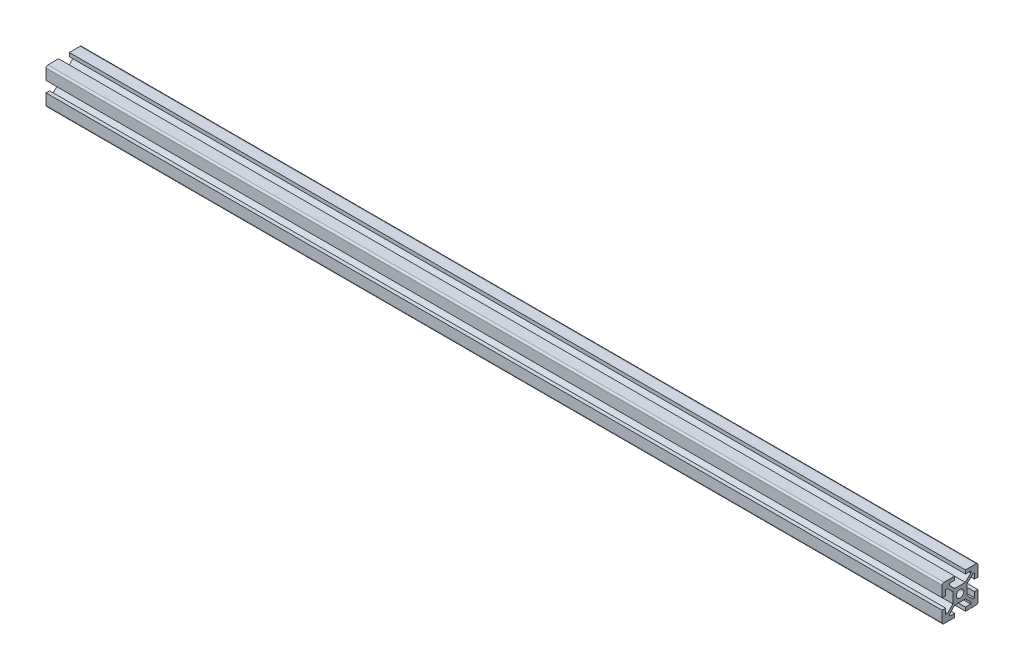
ISO-10303-21;
HEADER;
FILE_DESCRIPTION(('STEP AP214'),'2;1');
FILE_NAME('part.step','',(''),(''),'','','');
FILE_SCHEMA(('AUTOMOTIVE_DESIGN { 1 0 10303 214 1 1 1 1 }'));
ENDSEC;
DATA;
#1=APPLICATION_CONTEXT('core data for automotive mechanical design processes');
#2=APPLICATION_PROTOCOL_DEFINITION('international standard','automotive_design',2000,#1);
#3=PRODUCT_CONTEXT('',#1,'mechanical');
#4=PRODUCT('Part','Part','',(#3));
#5=PRODUCT_RELATED_PRODUCT_CATEGORY('part','',(#4));
#6=PRODUCT_DEFINITION_FORMATION('','',#4);
#7=PRODUCT_DEFINITION_CONTEXT('part definition',#1,'design');
#8=PRODUCT_DEFINITION('design','',#6,#7);
#9=PRODUCT_DEFINITION_SHAPE('','',#8);
#10=(LENGTH_UNIT() NAMED_UNIT(*) SI_UNIT(.MILLI.,.METRE.));
#11=(NAMED_UNIT(*) PLANE_ANGLE_UNIT() SI_UNIT($,.RADIAN.));
#12=(NAMED_UNIT(*) SI_UNIT($,.STERADIAN.) SOLID_ANGLE_UNIT());
#13=UNCERTAINTY_MEASURE_WITH_UNIT(LENGTH_MEASURE(1.E-05),#10,'distance_accuracy_value','');
#14=(GEOMETRIC_REPRESENTATION_CONTEXT(3) GLOBAL_UNCERTAINTY_ASSIGNED_CONTEXT((#13)) GLOBAL_UNIT_ASSIGNED_CONTEXT((#10,
#11,#12)) REPRESENTATION_CONTEXT('',''));
#15=CARTESIAN_POINT('',(0.,0.,0.));
#16=DIRECTION('',(0.,0.,1.));
#17=DIRECTION('',(1.,0.,0.));
#18=AXIS2_PLACEMENT_3D('',#15,#16,#17);
#19=CARTESIAN_POINT('',(500.,9.,9.));
#20=DIRECTION('',(1.,0.,0.));
#21=DIRECTION('',(0.,0.,-1.));
#22=AXIS2_PLACEMENT_3D('',#19,#20,#21);
#23=PLANE('',#22);
#24=CARTESIAN_POINT('',(500.,9.,9.));
#25=DIRECTION('',(1.,0.,0.));
#26=DIRECTION('',(0.,0.,-1.));
#27=AXIS2_PLACEMENT_3D('',#24,#25,#26);
#28=CIRCLE('',#27,1.);
#29=CARTESIAN_POINT('',(500.,10.,9.));
#30=VERTEX_POINT('',#29);
#31=CARTESIAN_POINT('',(500.,9.,10.));
#32=VERTEX_POINT('',#31);
#33=EDGE_CURVE('E474',#30,#32,#28,.T.);
#34=ORIENTED_EDGE('',*,*,#33,.T.);
#35=DIRECTION('',(0.,-1.,0.));
#36=VECTOR('',#35,1.);
#37=CARTESIAN_POINT('',(500.,9.,10.));
#38=LINE('',#37,#36);
#39=CARTESIAN_POINT('',(500.,3.,10.));
#40=VERTEX_POINT('',#39);
#41=EDGE_CURVE('E217',#32,#40,#38,.T.);
#42=ORIENTED_EDGE('',*,*,#41,.T.);
#43=DIRECTION('',(0.,0.,-1.));
#44=VECTOR('',#43,1.);
#45=CARTESIAN_POINT('',(500.,3.,10.));
#46=LINE('',#45,#44);
#47=CARTESIAN_POINT('',(500.,3.,8.));
#48=VERTEX_POINT('',#47);
#49=EDGE_CURVE('E607',#40,#48,#46,.T.);
#50=ORIENTED_EDGE('',*,*,#49,.T.);
#51=DIRECTION('',(0.,1.,0.));
#52=VECTOR('',#51,1.);
#53=CARTESIAN_POINT('',(500.,3.,8.));
#54=LINE('',#53,#52);
#55=CARTESIAN_POINT('',(500.,6.,8.));
#56=VERTEX_POINT('',#55);
#57=EDGE_CURVE('E622',#48,#56,#54,.T.);
#58=ORIENTED_EDGE('',*,*,#57,.T.);
#59=DIRECTION('',(0.,0.,-1.));
#60=VECTOR('',#59,1.);
#61=CARTESIAN_POINT('',(500.,6.,8.));
#62=LINE('',#61,#60);
#63=CARTESIAN_POINT('',(500.,6.,7.06066017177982));
#64=VERTEX_POINT('',#63);
#65=EDGE_CURVE('E621',#56,#64,#62,.T.);
#66=ORIENTED_EDGE('',*,*,#65,.T.);
#67=DIRECTION('',(0.,-0.707106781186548,-0.707106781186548));
#68=VECTOR('',#67,1.);
#69=CARTESIAN_POINT('',(500.,6.,7.06066017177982));
#70=LINE('',#69,#68);
#71=CARTESIAN_POINT('',(500.,2.93933982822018,4.));
#72=VERTEX_POINT('',#71);
#73=EDGE_CURVE('E623',#64,#72,#70,.T.);
#74=ORIENTED_EDGE('',*,*,#73,.T.);
#75=DIRECTION('',(0.,-1.,0.));
#76=VECTOR('',#75,1.);
#77=CARTESIAN_POINT('',(500.,2.93933982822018,4.));
#78=LINE('',#77,#76);
#79=CARTESIAN_POINT('',(500.,-2.93933982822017,4.));
#80=VERTEX_POINT('',#79);
#81=EDGE_CURVE('E629',#72,#80,#78,.T.);
#82=ORIENTED_EDGE('',*,*,#81,.T.);
#83=DIRECTION('',(0.,-0.707106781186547,0.707106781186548));
#84=VECTOR('',#83,1.);
#85=CARTESIAN_POINT('',(500.,-2.93933982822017,4.));
#86=LINE('',#85,#84);
#87=CARTESIAN_POINT('',(500.,-6.,7.06066017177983));
#88=VERTEX_POINT('',#87);
#89=EDGE_CURVE('E631',#80,#88,#86,.T.);
#90=ORIENTED_EDGE('',*,*,#89,.T.);
#91=DIRECTION('',(0.,0.,1.));
#92=VECTOR('',#91,1.);
#93=CARTESIAN_POINT('',(500.,-6.,7.06066017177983));
#94=LINE('',#93,#92);
#95=CARTESIAN_POINT('',(500.,-6.,7.99999999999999));
#96=VERTEX_POINT('',#95);
#97=EDGE_CURVE('E634',#88,#96,#94,.T.);
#98=ORIENTED_EDGE('',*,*,#97,.T.);
#99=DIRECTION('',(0.,1.,0.));
#100=VECTOR('',#99,1.);
#101=CARTESIAN_POINT('',(500.,-6.,7.99999999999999));
#102=LINE('',#101,#100);
#103=CARTESIAN_POINT('',(500.,-3.,7.99999999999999));
#104=VERTEX_POINT('',#103);
#105=EDGE_CURVE('E640',#96,#104,#102,.T.);
#106=ORIENTED_EDGE('',*,*,#105,.T.);
#107=DIRECTION('',(0.,0.,1.));
#108=VECTOR('',#107,1.);
#109=CARTESIAN_POINT('',(500.,-3.,7.99999999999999));
#110=LINE('',#109,#108);
#111=CARTESIAN_POINT('',(500.,-3.,10.));
#112=VERTEX_POINT('',#111);
#113=EDGE_CURVE('E639',#104,#112,#110,.T.);
#114=ORIENTED_EDGE('',*,*,#113,.T.);
#115=DIRECTION('',(0.,-1.,0.));
#116=VECTOR('',#115,1.);
#117=CARTESIAN_POINT('',(500.,-3.,10.));
#118=LINE('',#117,#116);
#119=CARTESIAN_POINT('',(500.,-9.,10.));
#120=VERTEX_POINT('',#119);
#121=EDGE_CURVE('E641',#112,#120,#118,.T.);
#122=ORIENTED_EDGE('',*,*,#121,.T.);
#123=CARTESIAN_POINT('',(500.,-9.,9.));
#124=DIRECTION('',(1.,0.,0.));
#125=DIRECTION('',(0.,0.,-1.));
#126=AXIS2_PLACEMENT_3D('',#123,#124,#125);
#127=CIRCLE('',#126,1.);
#128=CARTESIAN_POINT('',(500.,-10.,9.));
#129=VERTEX_POINT('',#128);
#130=EDGE_CURVE('E643',#120,#129,#127,.T.);
#131=ORIENTED_EDGE('',*,*,#130,.T.);
#132=DIRECTION('',(0.,0.,-1.));
#133=VECTOR('',#132,1.);
#134=CARTESIAN_POINT('',(500.,-10.,9.));
#135=LINE('',#134,#133);
#136=CARTESIAN_POINT('',(500.,-10.,3.));
#137=VERTEX_POINT('',#136);
#138=EDGE_CURVE('E644',#129,#137,#135,.T.);
#139=ORIENTED_EDGE('',*,*,#138,.T.);
#140=DIRECTION('',(0.,1.,0.));
#141=VECTOR('',#140,1.);
#142=CARTESIAN_POINT('',(500.,-10.,3.));
#143=LINE('',#142,#141);
#144=CARTESIAN_POINT('',(500.,-8.,3.));
#145=VERTEX_POINT('',#144);
#146=EDGE_CURVE('E650',#137,#145,#143,.T.);
#147=ORIENTED_EDGE('',*,*,#146,.T.);
#148=DIRECTION('',(0.,0.,1.));
#149=VECTOR('',#148,1.);
#150=CARTESIAN_POINT('',(500.,-8.,3.));
#151=LINE('',#150,#149);
#152=CARTESIAN_POINT('',(500.,-8.,6.));
#153=VERTEX_POINT('',#152);
#154=EDGE_CURVE('E647',#145,#153,#151,.T.);
#155=ORIENTED_EDGE('',*,*,#154,.T.);
#156=DIRECTION('',(0.,1.,0.));
#157=VECTOR('',#156,1.);
#158=CARTESIAN_POINT('',(500.,-8.,6.));
#159=LINE('',#158,#157);
#160=CARTESIAN_POINT('',(500.,-7.06066017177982,6.));
#161=VERTEX_POINT('',#160);
#162=EDGE_CURVE('E651',#153,#161,#159,.T.);
#163=ORIENTED_EDGE('',*,*,#162,.T.);
#164=DIRECTION('',(0.,0.707106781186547,-0.707106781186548));
#165=VECTOR('',#164,1.);
#166=CARTESIAN_POINT('',(500.,-7.06066017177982,6.));
#167=LINE('',#166,#165);
#168=CARTESIAN_POINT('',(500.,-4.,2.93933982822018));
#169=VERTEX_POINT('',#168);
#170=EDGE_CURVE('E652',#161,#169,#167,.T.);
#171=ORIENTED_EDGE('',*,*,#170,.T.);
#172=DIRECTION('',(0.,0.,-1.));
#173=VECTOR('',#172,1.);
#174=CARTESIAN_POINT('',(500.,-4.,2.93933982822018));
#175=LINE('',#174,#173);
#176=CARTESIAN_POINT('',(500.,-4.,-2.93933982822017));
#177=VERTEX_POINT('',#176);
#178=EDGE_CURVE('E654',#169,#177,#175,.T.);
#179=ORIENTED_EDGE('',*,*,#178,.T.);
#180=DIRECTION('',(0.,-0.707106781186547,-0.707106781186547));
#181=VECTOR('',#180,1.);
#182=CARTESIAN_POINT('',(500.,-4.,-2.93933982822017));
#183=LINE('',#182,#181);
#184=CARTESIAN_POINT('',(500.,-7.06066017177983,-6.));
#185=VERTEX_POINT('',#184);
#186=EDGE_CURVE('E660',#177,#185,#183,.T.);
#187=ORIENTED_EDGE('',*,*,#186,.T.);
#188=DIRECTION('',(0.,-1.,0.));
#189=VECTOR('',#188,1.);
#190=CARTESIAN_POINT('',(500.,-7.06066017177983,-6.));
#191=LINE('',#190,#189);
#192=CARTESIAN_POINT('',(500.,-7.99999999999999,-6.));
#193=VERTEX_POINT('',#192);
#194=EDGE_CURVE('E656',#185,#193,#191,.T.);
#195=ORIENTED_EDGE('',*,*,#194,.T.);
#196=DIRECTION('',(0.,0.,1.));
#197=VECTOR('',#196,1.);
#198=CARTESIAN_POINT('',(500.,-7.99999999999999,-6.));
#199=LINE('',#198,#197);
#200=CARTESIAN_POINT('',(500.,-7.99999999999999,-3.));
#201=VERTEX_POINT('',#200);
#202=EDGE_CURVE('E662',#193,#201,#199,.T.);
#203=ORIENTED_EDGE('',*,*,#202,.T.);
#204=DIRECTION('',(0.,-1.,0.));
#205=VECTOR('',#204,1.);
#206=CARTESIAN_POINT('',(500.,-7.99999999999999,-3.));
#207=LINE('',#206,#205);
#208=CARTESIAN_POINT('',(500.,-10.,-3.));
#209=VERTEX_POINT('',#208);
#210=EDGE_CURVE('E663',#201,#209,#207,.T.);
#211=ORIENTED_EDGE('',*,*,#210,.T.);
#212=DIRECTION('',(0.,0.,-1.));
#213=VECTOR('',#212,1.);
#214=CARTESIAN_POINT('',(500.,-10.,-3.));
#215=LINE('',#214,#213);
#216=CARTESIAN_POINT('',(500.,-10.,-9.00000000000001));
#217=VERTEX_POINT('',#216);
#218=EDGE_CURVE('E661',#209,#217,#215,.T.);
#219=ORIENTED_EDGE('',*,*,#218,.T.);
#220=CARTESIAN_POINT('',(500.,-9.,-9.00000000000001));
#221=DIRECTION('',(1.,0.,0.));
#222=DIRECTION('',(0.,0.,-1.));
#223=AXIS2_PLACEMENT_3D('',#220,#221,#222);
#224=CIRCLE('',#223,0.999999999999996);
#225=CARTESIAN_POINT('',(500.,-9.,-10.));
#226=VERTEX_POINT('',#225);
#227=EDGE_CURVE('E670',#217,#226,#224,.T.);
#228=ORIENTED_EDGE('',*,*,#227,.T.);
#229=DIRECTION('',(0.,1.,0.));
#230=VECTOR('',#229,1.);
#231=CARTESIAN_POINT('',(500.,-9.,-10.));
#232=LINE('',#231,#230);
#233=CARTESIAN_POINT('',(500.,-3.,-10.));
#234=VERTEX_POINT('',#233);
#235=EDGE_CURVE('E667',#226,#234,#232,.T.);
#236=ORIENTED_EDGE('',*,*,#235,.T.);
#237=DIRECTION('',(0.,0.,1.));
#238=VECTOR('',#237,1.);
#239=CARTESIAN_POINT('',(500.,-3.,-10.));
#240=LINE('',#239,#238);
#241=CARTESIAN_POINT('',(500.,-3.,-8.00000000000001));
#242=VERTEX_POINT('',#241);
#243=EDGE_CURVE('E674',#234,#242,#240,.T.);
#244=ORIENTED_EDGE('',*,*,#243,.T.);
#245=DIRECTION('',(0.,-1.,0.));
#246=VECTOR('',#245,1.);
#247=CARTESIAN_POINT('',(500.,-3.,-8.00000000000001));
#248=LINE('',#247,#246);
#249=CARTESIAN_POINT('',(500.,-6.,-8.00000000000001));
#250=VERTEX_POINT('',#249);
#251=EDGE_CURVE('E675',#242,#250,#248,.T.);
#252=ORIENTED_EDGE('',*,*,#251,.T.);
#253=DIRECTION('',(0.,0.,1.));
#254=VECTOR('',#253,1.);
#255=CARTESIAN_POINT('',(500.,-6.,-8.00000000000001));
#256=LINE('',#255,#254);
#257=CARTESIAN_POINT('',(500.,-6.,-7.06066017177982));
#258=VERTEX_POINT('',#257);
#259=EDGE_CURVE('E672',#250,#258,#256,.T.);
#260=ORIENTED_EDGE('',*,*,#259,.T.);
#261=DIRECTION('',(0.,0.707106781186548,0.707106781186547));
#262=VECTOR('',#261,1.);
#263=CARTESIAN_POINT('',(500.,-6.,-7.06066017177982));
#264=LINE('',#263,#262);
#265=CARTESIAN_POINT('',(500.,-2.93933982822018,-4.));
#266=VERTEX_POINT('',#265);
#267=EDGE_CURVE('E679',#258,#266,#264,.T.);
#268=ORIENTED_EDGE('',*,*,#267,.T.);
#269=DIRECTION('',(0.,1.,0.));
#270=VECTOR('',#269,1.);
#271=CARTESIAN_POINT('',(500.,-2.93933982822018,-4.));
#272=LINE('',#271,#270);
#273=CARTESIAN_POINT('',(500.,2.93933982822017,-4.));
#274=VERTEX_POINT('',#273);
#275=EDGE_CURVE('E676',#266,#274,#272,.T.);
#276=ORIENTED_EDGE('',*,*,#275,.T.);
#277=DIRECTION('',(0.,0.707106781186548,-0.707106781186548));
#278=VECTOR('',#277,1.);
#279=CARTESIAN_POINT('',(500.,2.93933982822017,-4.));
#280=LINE('',#279,#278);
#281=CARTESIAN_POINT('',(500.,6.,-7.06066017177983));
#282=VERTEX_POINT('',#281);
#283=EDGE_CURVE('E682',#274,#282,#280,.T.);
#284=ORIENTED_EDGE('',*,*,#283,.T.);
#285=DIRECTION('',(0.,0.,-1.));
#286=VECTOR('',#285,1.);
#287=CARTESIAN_POINT('',(500.,6.,-7.06066017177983));
#288=LINE('',#287,#286);
#289=CARTESIAN_POINT('',(500.,6.,-7.99999999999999));
#290=VERTEX_POINT('',#289);
#291=EDGE_CURVE('E681',#282,#290,#288,.T.);
#292=ORIENTED_EDGE('',*,*,#291,.T.);
#293=DIRECTION('',(0.,-1.,0.));
#294=VECTOR('',#293,1.);
#295=CARTESIAN_POINT('',(500.,6.,-7.99999999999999));
#296=LINE('',#295,#294);
#297=CARTESIAN_POINT('',(500.,3.,-7.99999999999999));
#298=VERTEX_POINT('',#297);
#299=EDGE_CURVE('E683',#290,#298,#296,.T.);
#300=ORIENTED_EDGE('',*,*,#299,.T.);
#301=DIRECTION('',(0.,0.,-1.));
#302=VECTOR('',#301,1.);
#303=CARTESIAN_POINT('',(500.,3.,-7.99999999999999));
#304=LINE('',#303,#302);
#305=CARTESIAN_POINT('',(500.,3.,-10.));
#306=VERTEX_POINT('',#305);
#307=EDGE_CURVE('E690',#298,#306,#304,.T.);
#308=ORIENTED_EDGE('',*,*,#307,.T.);
#309=DIRECTION('',(0.,1.,0.));
#310=VECTOR('',#309,1.);
#311=CARTESIAN_POINT('',(500.,3.,-10.));
#312=LINE('',#311,#310);
#313=CARTESIAN_POINT('',(500.,9.,-10.));
#314=VERTEX_POINT('',#313);
#315=EDGE_CURVE('E689',#306,#314,#312,.T.);
#316=ORIENTED_EDGE('',*,*,#315,.T.);
#317=CARTESIAN_POINT('',(500.,9.,-9.00000000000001));
#318=DIRECTION('',(1.,0.,0.));
#319=DIRECTION('',(0.,0.,-1.));
#320=AXIS2_PLACEMENT_3D('',#317,#318,#319);
#321=CIRCLE('',#320,1.);
#322=CARTESIAN_POINT('',(500.,10.,-9.00000000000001));
#323=VERTEX_POINT('',#322);
#324=EDGE_CURVE('E693',#314,#323,#321,.T.);
#325=ORIENTED_EDGE('',*,*,#324,.T.);
#326=DIRECTION('',(0.,0.,1.));
#327=VECTOR('',#326,1.);
#328=CARTESIAN_POINT('',(500.,10.,-9.00000000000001));
#329=LINE('',#328,#327);
#330=CARTESIAN_POINT('',(500.,10.,-3.));
#331=VERTEX_POINT('',#330);
#332=EDGE_CURVE('E691',#323,#331,#329,.T.);
#333=ORIENTED_EDGE('',*,*,#332,.T.);
#334=DIRECTION('',(0.,-1.,0.));
#335=VECTOR('',#334,1.);
#336=CARTESIAN_POINT('',(500.,10.,-3.));
#337=LINE('',#336,#335);
#338=CARTESIAN_POINT('',(500.,8.,-3.));
#339=VERTEX_POINT('',#338);
#340=EDGE_CURVE('E694',#331,#339,#337,.T.);
#341=ORIENTED_EDGE('',*,*,#340,.T.);
#342=DIRECTION('',(0.,0.,-1.));
#343=VECTOR('',#342,1.);
#344=CARTESIAN_POINT('',(500.,8.,-3.));
#345=LINE('',#344,#343);
#346=CARTESIAN_POINT('',(500.,8.,-6.));
#347=VERTEX_POINT('',#346);
#348=EDGE_CURVE('E696',#339,#347,#345,.T.);
#349=ORIENTED_EDGE('',*,*,#348,.T.);
#350=DIRECTION('',(0.,-1.,0.));
#351=VECTOR('',#350,1.);
#352=CARTESIAN_POINT('',(500.,8.,-6.));
#353=LINE('',#352,#351);
#354=CARTESIAN_POINT('',(500.,7.06066017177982,-6.));
#355=VERTEX_POINT('',#354);
#356=EDGE_CURVE('E698',#347,#355,#353,.T.);
#357=ORIENTED_EDGE('',*,*,#356,.T.);
#358=DIRECTION('',(0.,-0.707106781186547,0.707106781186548));
#359=VECTOR('',#358,1.);
#360=CARTESIAN_POINT('',(500.,7.06066017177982,-6.));
#361=LINE('',#360,#359);
#362=CARTESIAN_POINT('',(500.,4.,-2.93933982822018));
#363=VERTEX_POINT('',#362);
#364=EDGE_CURVE('E702',#355,#363,#361,.T.);
#365=ORIENTED_EDGE('',*,*,#364,.T.);
#366=DIRECTION('',(0.,0.,1.));
#367=VECTOR('',#366,1.);
#368=CARTESIAN_POINT('',(500.,4.,-2.93933982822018));
#369=LINE('',#368,#367);
#370=CARTESIAN_POINT('',(500.,4.,2.93933982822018));
#371=VERTEX_POINT('',#370);
#372=EDGE_CURVE('E705',#363,#371,#369,.T.);
#373=ORIENTED_EDGE('',*,*,#372,.T.);
#374=DIRECTION('',(0.,0.707106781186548,0.707106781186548));
#375=VECTOR('',#374,1.);
#376=CARTESIAN_POINT('',(500.,4.,2.93933982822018));
#377=LINE('',#376,#375);
#378=CARTESIAN_POINT('',(500.,7.06066017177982,6.));
#379=VERTEX_POINT('',#378);
#380=EDGE_CURVE('E703',#371,#379,#377,.T.);
#381=ORIENTED_EDGE('',*,*,#380,.T.);
#382=DIRECTION('',(0.,1.,0.));
#383=VECTOR('',#382,1.);
#384=CARTESIAN_POINT('',(500.,7.06066017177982,6.));
#385=LINE('',#384,#383);
#386=CARTESIAN_POINT('',(500.,7.99999999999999,6.));
#387=VERTEX_POINT('',#386);
#388=EDGE_CURVE('E359',#379,#387,#385,.T.);
#389=ORIENTED_EDGE('',*,*,#388,.T.);
#390=DIRECTION('',(0.,0.,-1.));
#391=VECTOR('',#390,1.);
#392=CARTESIAN_POINT('',(500.,7.99999999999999,6.));
#393=LINE('',#392,#391);
#394=CARTESIAN_POINT('',(500.,7.99999999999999,3.));
#395=VERTEX_POINT('',#394);
#396=EDGE_CURVE('E355',#387,#395,#393,.T.);
#397=ORIENTED_EDGE('',*,*,#396,.T.);
#398=DIRECTION('',(0.,1.,0.));
#399=VECTOR('',#398,1.);
#400=CARTESIAN_POINT('',(500.,7.99999999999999,3.));
#401=LINE('',#400,#399);
#402=CARTESIAN_POINT('',(500.,10.,3.));
#403=VERTEX_POINT('',#402);
#404=EDGE_CURVE('E357',#395,#403,#401,.T.);
#405=ORIENTED_EDGE('',*,*,#404,.T.);
#406=DIRECTION('',(0.,0.,1.));
#407=VECTOR('',#406,1.);
#408=CARTESIAN_POINT('',(500.,10.,3.));
#409=LINE('',#408,#407);
#410=EDGE_CURVE('E57',#403,#30,#409,.T.);
#411=ORIENTED_EDGE('',*,*,#410,.T.);
#412=EDGE_LOOP('',(#34,#42,#50,#58,#66,#74,#82,#90,#98,#106,#114,#122,#131,#139,#147,#155,#163,
#171,#179,#187,#195,#203,#211,#219,#228,#236,#244,#252,#260,#268,#276,#284,#292,#300,#308,#316,
#325,#333,#341,#349,#357,#365,#373,#381,#389,#397,#405,#411));
#413=FACE_BOUND('',#412,.T.);
#414=CARTESIAN_POINT('',(500.,0.,0.));
#415=DIRECTION('',(1.,0.,0.));
#416=DIRECTION('',(0.,0.,-1.));
#417=AXIS2_PLACEMENT_3D('',#414,#415,#416);
#418=CIRCLE('',#417,2.1);
#419=CARTESIAN_POINT('',(500.,0.,-2.1));
#420=VERTEX_POINT('',#419);
#421=EDGE_CURVE('E378',#420,#420,#418,.T.);
#422=ORIENTED_EDGE('',*,*,#421,.F.);
#423=EDGE_LOOP('',(#422));
#424=FACE_BOUND('',#423,.T.);
#425=ADVANCED_FACE('F39',(#413,#424),#23,.T.);
#426=CARTESIAN_POINT('',(0.,9.,9.));
#427=DIRECTION('',(1.,0.,0.));
#428=DIRECTION('',(0.,0.,-1.));
#429=AXIS2_PLACEMENT_3D('',#426,#427,#428);
#430=PLANE('',#429);
#431=CARTESIAN_POINT('',(0.,9.,9.));
#432=DIRECTION('',(1.,0.,0.));
#433=DIRECTION('',(0.,0.,-1.));
#434=AXIS2_PLACEMENT_3D('',#431,#432,#433);
#435=CIRCLE('',#434,1.);
#436=CARTESIAN_POINT('',(0.,10.,9.));
#437=VERTEX_POINT('',#436);
#438=CARTESIAN_POINT('',(0.,9.,10.));
#439=VERTEX_POINT('',#438);
#440=EDGE_CURVE('E377',#437,#439,#435,.T.);
#441=ORIENTED_EDGE('',*,*,#440,.F.);
#442=DIRECTION('',(0.,0.,1.));
#443=VECTOR('',#442,1.);
#444=CARTESIAN_POINT('',(0.,10.,3.));
#445=LINE('',#444,#443);
#446=CARTESIAN_POINT('',(0.,10.,3.));
#447=VERTEX_POINT('',#446);
#448=EDGE_CURVE('E212',#447,#437,#445,.T.);
#449=ORIENTED_EDGE('',*,*,#448,.F.);
#450=DIRECTION('',(0.,1.,0.));
#451=VECTOR('',#450,1.);
#452=CARTESIAN_POINT('',(0.,7.99999999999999,3.));
#453=LINE('',#452,#451);
#454=CARTESIAN_POINT('',(0.,7.99999999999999,3.));
#455=VERTEX_POINT('',#454);
#456=EDGE_CURVE('E204',#455,#447,#453,.T.);
#457=ORIENTED_EDGE('',*,*,#456,.F.);
#458=DIRECTION('',(0.,0.,-1.));
#459=VECTOR('',#458,1.);
#460=CARTESIAN_POINT('',(0.,7.99999999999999,6.));
#461=LINE('',#460,#459);
#462=CARTESIAN_POINT('',(0.,7.99999999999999,6.));
#463=VERTEX_POINT('',#462);
#464=EDGE_CURVE('E368',#463,#455,#461,.T.);
#465=ORIENTED_EDGE('',*,*,#464,.F.);
#466=DIRECTION('',(0.,1.,0.));
#467=VECTOR('',#466,1.);
#468=CARTESIAN_POINT('',(0.,7.06066017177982,6.));
#469=LINE('',#468,#467);
#470=CARTESIAN_POINT('',(0.,7.06066017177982,6.));
#471=VERTEX_POINT('',#470);
#472=EDGE_CURVE('E468',#471,#463,#469,.T.);
#473=ORIENTED_EDGE('',*,*,#472,.F.);
#474=DIRECTION('',(0.,0.707106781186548,0.707106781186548));
#475=VECTOR('',#474,1.);
#476=CARTESIAN_POINT('',(0.,4.,2.93933982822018));
#477=LINE('',#476,#475);
#478=CARTESIAN_POINT('',(0.,4.,2.93933982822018));
#479=VERTEX_POINT('',#478);
#480=EDGE_CURVE('E464',#479,#471,#477,.T.);
#481=ORIENTED_EDGE('',*,*,#480,.F.);
#482=DIRECTION('',(0.,0.,1.));
#483=VECTOR('',#482,1.);
#484=CARTESIAN_POINT('',(0.,4.,-2.93933982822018));
#485=LINE('',#484,#483);
#486=CARTESIAN_POINT('',(0.,4.,-2.93933982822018));
#487=VERTEX_POINT('',#486);
#488=EDGE_CURVE('E465',#487,#479,#485,.T.);
#489=ORIENTED_EDGE('',*,*,#488,.F.);
#490=DIRECTION('',(0.,-0.707106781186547,0.707106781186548));
#491=VECTOR('',#490,1.);
#492=CARTESIAN_POINT('',(0.,7.06066017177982,-6.));
#493=LINE('',#492,#491);
#494=CARTESIAN_POINT('',(0.,7.06066017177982,-6.));
#495=VERTEX_POINT('',#494);
#496=EDGE_CURVE('E458',#495,#487,#493,.T.);
#497=ORIENTED_EDGE('',*,*,#496,.F.);
#498=DIRECTION('',(0.,-1.,0.));
#499=VECTOR('',#498,1.);
#500=CARTESIAN_POINT('',(0.,8.,-6.));
#501=LINE('',#500,#499);
#502=CARTESIAN_POINT('',(0.,8.,-6.));
#503=VERTEX_POINT('',#502);
#504=EDGE_CURVE('E456',#503,#495,#501,.T.);
#505=ORIENTED_EDGE('',*,*,#504,.F.);
#506=DIRECTION('',(0.,0.,-1.));
#507=VECTOR('',#506,1.);
#508=CARTESIAN_POINT('',(0.,8.,-3.));
#509=LINE('',#508,#507);
#510=CARTESIAN_POINT('',(0.,8.,-3.));
#511=VERTEX_POINT('',#510);
#512=EDGE_CURVE('E457',#511,#503,#509,.T.);
#513=ORIENTED_EDGE('',*,*,#512,.F.);
#514=DIRECTION('',(0.,-1.,0.));
#515=VECTOR('',#514,1.);
#516=CARTESIAN_POINT('',(0.,10.,-3.));
#517=LINE('',#516,#515);
#518=CARTESIAN_POINT('',(0.,10.,-3.));
#519=VERTEX_POINT('',#518);
#520=EDGE_CURVE('E451',#519,#511,#517,.T.);
#521=ORIENTED_EDGE('',*,*,#520,.F.);
#522=DIRECTION('',(0.,0.,1.));
#523=VECTOR('',#522,1.);
#524=CARTESIAN_POINT('',(0.,10.,-9.00000000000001));
#525=LINE('',#524,#523);
#526=CARTESIAN_POINT('',(0.,10.,-9.00000000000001));
#527=VERTEX_POINT('',#526);
#528=EDGE_CURVE('E454',#527,#519,#525,.T.);
#529=ORIENTED_EDGE('',*,*,#528,.F.);
#530=CARTESIAN_POINT('',(0.,9.,-9.00000000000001));
#531=DIRECTION('',(1.,0.,0.));
#532=DIRECTION('',(0.,0.,-1.));
#533=AXIS2_PLACEMENT_3D('',#530,#531,#532);
#534=CIRCLE('',#533,1.);
#535=CARTESIAN_POINT('',(0.,9.,-10.));
#536=VERTEX_POINT('',#535);
#537=EDGE_CURVE('E447',#536,#527,#534,.T.);
#538=ORIENTED_EDGE('',*,*,#537,.F.);
#539=DIRECTION('',(0.,1.,0.));
#540=VECTOR('',#539,1.);
#541=CARTESIAN_POINT('',(0.,3.,-10.));
#542=LINE('',#541,#540);
#543=CARTESIAN_POINT('',(0.,3.,-10.));
#544=VERTEX_POINT('',#543);
#545=EDGE_CURVE('E450',#544,#536,#542,.T.);
#546=ORIENTED_EDGE('',*,*,#545,.F.);
#547=DIRECTION('',(0.,0.,-1.));
#548=VECTOR('',#547,1.);
#549=CARTESIAN_POINT('',(0.,3.,-7.99999999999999));
#550=LINE('',#549,#548);
#551=CARTESIAN_POINT('',(0.,3.,-7.99999999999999));
#552=VERTEX_POINT('',#551);
#553=EDGE_CURVE('E449',#552,#544,#550,.T.);
#554=ORIENTED_EDGE('',*,*,#553,.F.);
#555=DIRECTION('',(0.,-1.,0.));
#556=VECTOR('',#555,1.);
#557=CARTESIAN_POINT('',(0.,6.,-7.99999999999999));
#558=LINE('',#557,#556);
#559=CARTESIAN_POINT('',(0.,6.,-7.99999999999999));
#560=VERTEX_POINT('',#559);
#561=EDGE_CURVE('E442',#560,#552,#558,.T.);
#562=ORIENTED_EDGE('',*,*,#561,.F.);
#563=DIRECTION('',(0.,0.,-1.));
#564=VECTOR('',#563,1.);
#565=CARTESIAN_POINT('',(0.,6.,-7.06066017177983));
#566=LINE('',#565,#564);
#567=CARTESIAN_POINT('',(0.,6.,-7.06066017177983));
#568=VERTEX_POINT('',#567);
#569=EDGE_CURVE('E445',#568,#560,#566,.T.);
#570=ORIENTED_EDGE('',*,*,#569,.F.);
#571=DIRECTION('',(0.,0.707106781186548,-0.707106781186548));
#572=VECTOR('',#571,1.);
#573=CARTESIAN_POINT('',(0.,2.93933982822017,-4.));
#574=LINE('',#573,#572);
#575=CARTESIAN_POINT('',(0.,2.93933982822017,-4.));
#576=VERTEX_POINT('',#575);
#577=EDGE_CURVE('E436',#576,#568,#574,.T.);
#578=ORIENTED_EDGE('',*,*,#577,.F.);
#579=DIRECTION('',(0.,1.,0.));
#580=VECTOR('',#579,1.);
#581=CARTESIAN_POINT('',(0.,-2.93933982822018,-4.));
#582=LINE('',#581,#580);
#583=CARTESIAN_POINT('',(0.,-2.93933982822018,-4.));
#584=VERTEX_POINT('',#583);
#585=EDGE_CURVE('E438',#584,#576,#582,.T.);
#586=ORIENTED_EDGE('',*,*,#585,.F.);
#587=DIRECTION('',(0.,0.707106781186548,0.707106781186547));
#588=VECTOR('',#587,1.);
#589=CARTESIAN_POINT('',(0.,-6.,-7.06066017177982));
#590=LINE('',#589,#588);
#591=CARTESIAN_POINT('',(0.,-6.,-7.06066017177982));
#592=VERTEX_POINT('',#591);
#593=EDGE_CURVE('E437',#592,#584,#590,.T.);
#594=ORIENTED_EDGE('',*,*,#593,.F.);
#595=DIRECTION('',(0.,0.,1.));
#596=VECTOR('',#595,1.);
#597=CARTESIAN_POINT('',(0.,-6.,-8.00000000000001));
#598=LINE('',#597,#596);
#599=CARTESIAN_POINT('',(0.,-6.,-8.00000000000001));
#600=VERTEX_POINT('',#599);
#601=EDGE_CURVE('E431',#600,#592,#598,.T.);
#602=ORIENTED_EDGE('',*,*,#601,.F.);
#603=DIRECTION('',(0.,-1.,0.));
#604=VECTOR('',#603,1.);
#605=CARTESIAN_POINT('',(0.,-3.,-8.00000000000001));
#606=LINE('',#605,#604);
#607=CARTESIAN_POINT('',(0.,-3.,-8.00000000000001));
#608=VERTEX_POINT('',#607);
#609=EDGE_CURVE('E435',#608,#600,#606,.T.);
#610=ORIENTED_EDGE('',*,*,#609,.F.);
#611=DIRECTION('',(0.,0.,1.));
#612=VECTOR('',#611,1.);
#613=CARTESIAN_POINT('',(0.,-3.,-10.));
#614=LINE('',#613,#612);
#615=CARTESIAN_POINT('',(0.,-3.,-10.));
#616=VERTEX_POINT('',#615);
#617=EDGE_CURVE('E429',#616,#608,#614,.T.);
#618=ORIENTED_EDGE('',*,*,#617,.F.);
#619=DIRECTION('',(0.,1.,0.));
#620=VECTOR('',#619,1.);
#621=CARTESIAN_POINT('',(0.,-9.,-10.));
#622=LINE('',#621,#620);
#623=CARTESIAN_POINT('',(0.,-9.,-10.));
#624=VERTEX_POINT('',#623);
#625=EDGE_CURVE('E427',#624,#616,#622,.T.);
#626=ORIENTED_EDGE('',*,*,#625,.F.);
#627=CARTESIAN_POINT('',(0.,-9.,-9.00000000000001));
#628=DIRECTION('',(1.,0.,0.));
#629=DIRECTION('',(0.,0.,-1.));
#630=AXIS2_PLACEMENT_3D('',#627,#628,#629);
#631=CIRCLE('',#630,0.999999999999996);
#632=CARTESIAN_POINT('',(0.,-10.,-9.00000000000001));
#633=VERTEX_POINT('',#632);
#634=EDGE_CURVE('E426',#633,#624,#631,.T.);
#635=ORIENTED_EDGE('',*,*,#634,.F.);
#636=DIRECTION('',(0.,0.,-1.));
#637=VECTOR('',#636,1.);
#638=CARTESIAN_POINT('',(0.,-10.,-3.));
#639=LINE('',#638,#637);
#640=CARTESIAN_POINT('',(0.,-10.,-3.));
#641=VERTEX_POINT('',#640);
#642=EDGE_CURVE('E422',#641,#633,#639,.T.);
#643=ORIENTED_EDGE('',*,*,#642,.F.);
#644=DIRECTION('',(0.,-1.,0.));
#645=VECTOR('',#644,1.);
#646=CARTESIAN_POINT('',(0.,-7.99999999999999,-3.));
#647=LINE('',#646,#645);
#648=CARTESIAN_POINT('',(0.,-7.99999999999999,-3.));
#649=VERTEX_POINT('',#648);
#650=EDGE_CURVE('E425',#649,#641,#647,.T.);
#651=ORIENTED_EDGE('',*,*,#650,.F.);
#652=DIRECTION('',(0.,0.,1.));
#653=VECTOR('',#652,1.);
#654=CARTESIAN_POINT('',(0.,-7.99999999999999,-6.));
#655=LINE('',#654,#653);
#656=CARTESIAN_POINT('',(0.,-7.99999999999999,-6.));
#657=VERTEX_POINT('',#656);
#658=EDGE_CURVE('E419',#657,#649,#655,.T.);
#659=ORIENTED_EDGE('',*,*,#658,.F.);
#660=DIRECTION('',(0.,-1.,0.));
#661=VECTOR('',#660,1.);
#662=CARTESIAN_POINT('',(0.,-7.06066017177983,-6.));
#663=LINE('',#662,#661);
#664=CARTESIAN_POINT('',(0.,-7.06066017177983,-6.));
#665=VERTEX_POINT('',#664);
#666=EDGE_CURVE('E418',#665,#657,#663,.T.);
#667=ORIENTED_EDGE('',*,*,#666,.F.);
#668=DIRECTION('',(0.,-0.707106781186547,-0.707106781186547));
#669=VECTOR('',#668,1.);
#670=CARTESIAN_POINT('',(0.,-4.,-2.93933982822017));
#671=LINE('',#670,#669);
#672=CARTESIAN_POINT('',(0.,-4.,-2.93933982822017));
#673=VERTEX_POINT('',#672);
#674=EDGE_CURVE('E416',#673,#665,#671,.T.);
#675=ORIENTED_EDGE('',*,*,#674,.F.);
#676=DIRECTION('',(0.,0.,-1.));
#677=VECTOR('',#676,1.);
#678=CARTESIAN_POINT('',(0.,-4.,2.93933982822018));
#679=LINE('',#678,#677);
#680=CARTESIAN_POINT('',(0.,-4.,2.93933982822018));
#681=VERTEX_POINT('',#680);
#682=EDGE_CURVE('E414',#681,#673,#679,.T.);
#683=ORIENTED_EDGE('',*,*,#682,.F.);
#684=DIRECTION('',(0.,0.707106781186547,-0.707106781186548));
#685=VECTOR('',#684,1.);
#686=CARTESIAN_POINT('',(0.,-7.06066017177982,6.));
#687=LINE('',#686,#685);
#688=CARTESIAN_POINT('',(0.,-7.06066017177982,6.));
#689=VERTEX_POINT('',#688);
#690=EDGE_CURVE('E415',#689,#681,#687,.T.);
#691=ORIENTED_EDGE('',*,*,#690,.F.);
#692=DIRECTION('',(0.,1.,0.));
#693=VECTOR('',#692,1.);
#694=CARTESIAN_POINT('',(0.,-8.,6.));
#695=LINE('',#694,#693);
#696=CARTESIAN_POINT('',(0.,-8.,6.));
#697=VERTEX_POINT('',#696);
#698=EDGE_CURVE('E409',#697,#689,#695,.T.);
#699=ORIENTED_EDGE('',*,*,#698,.F.);
#700=DIRECTION('',(0.,0.,1.));
#701=VECTOR('',#700,1.);
#702=CARTESIAN_POINT('',(0.,-8.,3.));
#703=LINE('',#702,#701);
#704=CARTESIAN_POINT('',(0.,-8.,3.));
#705=VERTEX_POINT('',#704);
#706=EDGE_CURVE('E406',#705,#697,#703,.T.);
#707=ORIENTED_EDGE('',*,*,#706,.F.);
#708=DIRECTION('',(0.,1.,0.));
#709=VECTOR('',#708,1.);
#710=CARTESIAN_POINT('',(0.,-10.,3.));
#711=LINE('',#710,#709);
#712=CARTESIAN_POINT('',(0.,-10.,3.));
#713=VERTEX_POINT('',#712);
#714=EDGE_CURVE('E408',#713,#705,#711,.T.);
#715=ORIENTED_EDGE('',*,*,#714,.F.);
#716=DIRECTION('',(0.,0.,-1.));
#717=VECTOR('',#716,1.);
#718=CARTESIAN_POINT('',(0.,-10.,9.));
#719=LINE('',#718,#717);
#720=CARTESIAN_POINT('',(0.,-10.,9.));
#721=VERTEX_POINT('',#720);
#722=EDGE_CURVE('E401',#721,#713,#719,.T.);
#723=ORIENTED_EDGE('',*,*,#722,.F.);
#724=CARTESIAN_POINT('',(0.,-9.,9.));
#725=DIRECTION('',(1.,0.,0.));
#726=DIRECTION('',(0.,0.,-1.));
#727=AXIS2_PLACEMENT_3D('',#724,#725,#726);
#728=CIRCLE('',#727,1.);
#729=CARTESIAN_POINT('',(0.,-9.,10.));
#730=VERTEX_POINT('',#729);
#731=EDGE_CURVE('E404',#730,#721,#728,.T.);
#732=ORIENTED_EDGE('',*,*,#731,.F.);
#733=DIRECTION('',(0.,-1.,0.));
#734=VECTOR('',#733,1.);
#735=CARTESIAN_POINT('',(0.,-3.,10.));
#736=LINE('',#735,#734);
#737=CARTESIAN_POINT('',(0.,-3.,10.));
#738=VERTEX_POINT('',#737);
#739=EDGE_CURVE('E397',#738,#730,#736,.T.);
#740=ORIENTED_EDGE('',*,*,#739,.F.);
#741=DIRECTION('',(0.,0.,1.));
#742=VECTOR('',#741,1.);
#743=CARTESIAN_POINT('',(0.,-3.,7.99999999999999));
#744=LINE('',#743,#742);
#745=CARTESIAN_POINT('',(0.,-3.,7.99999999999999));
#746=VERTEX_POINT('',#745);
#747=EDGE_CURVE('E400',#746,#738,#744,.T.);
#748=ORIENTED_EDGE('',*,*,#747,.F.);
#749=DIRECTION('',(0.,1.,0.));
#750=VECTOR('',#749,1.);
#751=CARTESIAN_POINT('',(0.,-6.,7.99999999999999));
#752=LINE('',#751,#750);
#753=CARTESIAN_POINT('',(0.,-6.,7.99999999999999));
#754=VERTEX_POINT('',#753);
#755=EDGE_CURVE('E399',#754,#746,#752,.T.);
#756=ORIENTED_EDGE('',*,*,#755,.F.);
#757=DIRECTION('',(0.,0.,1.));
#758=VECTOR('',#757,1.);
#759=CARTESIAN_POINT('',(0.,-6.,7.06066017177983));
#760=LINE('',#759,#758);
#761=CARTESIAN_POINT('',(0.,-6.,7.06066017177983));
#762=VERTEX_POINT('',#761);
#763=EDGE_CURVE('E392',#762,#754,#760,.T.);
#764=ORIENTED_EDGE('',*,*,#763,.F.);
#765=DIRECTION('',(0.,-0.707106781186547,0.707106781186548));
#766=VECTOR('',#765,1.);
#767=CARTESIAN_POINT('',(0.,-2.93933982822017,4.));
#768=LINE('',#767,#766);
#769=CARTESIAN_POINT('',(0.,-2.93933982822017,4.));
#770=VERTEX_POINT('',#769);
#771=EDGE_CURVE('E395',#770,#762,#768,.T.);
#772=ORIENTED_EDGE('',*,*,#771,.F.);
#773=DIRECTION('',(0.,-1.,0.));
#774=VECTOR('',#773,1.);
#775=CARTESIAN_POINT('',(0.,2.93933982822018,4.));
#776=LINE('',#775,#774);
#777=CARTESIAN_POINT('',(0.,2.93933982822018,4.));
#778=VERTEX_POINT('',#777);
#779=EDGE_CURVE('E386',#778,#770,#776,.T.);
#780=ORIENTED_EDGE('',*,*,#779,.F.);
#781=DIRECTION('',(0.,-0.707106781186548,-0.707106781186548));
#782=VECTOR('',#781,1.);
#783=CARTESIAN_POINT('',(0.,6.,7.06066017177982));
#784=LINE('',#783,#782);
#785=CARTESIAN_POINT('',(0.,6.,7.06066017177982));
#786=VERTEX_POINT('',#785);
#787=EDGE_CURVE('E388',#786,#778,#784,.T.);
#788=ORIENTED_EDGE('',*,*,#787,.F.);
#789=DIRECTION('',(0.,0.,-1.));
#790=VECTOR('',#789,1.);
#791=CARTESIAN_POINT('',(0.,6.,8.));
#792=LINE('',#791,#790);
#793=CARTESIAN_POINT('',(0.,6.,8.));
#794=VERTEX_POINT('',#793);
#795=EDGE_CURVE('E387',#794,#786,#792,.T.);
#796=ORIENTED_EDGE('',*,*,#795,.F.);
#797=DIRECTION('',(0.,1.,0.));
#798=VECTOR('',#797,1.);
#799=CARTESIAN_POINT('',(0.,3.,8.));
#800=LINE('',#799,#798);
#801=CARTESIAN_POINT('',(0.,3.,8.));
#802=VERTEX_POINT('',#801);
#803=EDGE_CURVE('E384',#802,#794,#800,.T.);
#804=ORIENTED_EDGE('',*,*,#803,.F.);
#805=DIRECTION('',(0.,0.,-1.));
#806=VECTOR('',#805,1.);
#807=CARTESIAN_POINT('',(0.,3.,10.));
#808=LINE('',#807,#806);
#809=CARTESIAN_POINT('',(0.,3.,10.));
#810=VERTEX_POINT('',#809);
#811=EDGE_CURVE('E385',#810,#802,#808,.T.);
#812=ORIENTED_EDGE('',*,*,#811,.F.);
#813=DIRECTION('',(0.,-1.,0.));
#814=VECTOR('',#813,1.);
#815=CARTESIAN_POINT('',(0.,9.,10.));
#816=LINE('',#815,#814);
#817=EDGE_CURVE('E376',#439,#810,#816,.T.);
#818=ORIENTED_EDGE('',*,*,#817,.F.);
#819=EDGE_LOOP('',(#441,#449,#457,#465,#473,#481,#489,#497,#505,#513,#521,#529,#538,#546,#554,
#562,#570,#578,#586,#594,#602,#610,#618,#626,#635,#643,#651,#659,#667,#675,#683,#691,#699,#707,
#715,#723,#732,#740,#748,#756,#764,#772,#780,#788,#796,#804,#812,#818));
#820=FACE_BOUND('',#819,.T.);
#821=CARTESIAN_POINT('',(0.,0.,0.));
#822=DIRECTION('',(1.,0.,0.));
#823=DIRECTION('',(0.,0.,-1.));
#824=AXIS2_PLACEMENT_3D('',#821,#822,#823);
#825=CIRCLE('',#824,2.1);
#826=CARTESIAN_POINT('',(0.,0.,-2.1));
#827=VERTEX_POINT('',#826);
#828=EDGE_CURVE('E1337',#827,#827,#825,.T.);
#829=ORIENTED_EDGE('',*,*,#828,.T.);
#830=EDGE_LOOP('',(#829));
#831=FACE_BOUND('',#830,.T.);
#832=ADVANCED_FACE('F608',(#820,#831),#430,.F.);
#833=CARTESIAN_POINT('',(500.,9.,9.));
#834=DIRECTION('',(-1.,0.,0.));
#835=DIRECTION('',(0.,0.,1.));
#836=AXIS2_PLACEMENT_3D('',#833,#834,#835);
#837=CYLINDRICAL_SURFACE('',#836,1.);
#838=ORIENTED_EDGE('',*,*,#440,.T.);
#839=DIRECTION('',(-1.,0.,0.));
#840=VECTOR('',#839,1.);
#841=CARTESIAN_POINT('',(500.,9.,10.));
#842=LINE('',#841,#840);
#843=EDGE_CURVE('E11',#32,#439,#842,.T.);
#844=ORIENTED_EDGE('',*,*,#843,.F.);
#845=ORIENTED_EDGE('',*,*,#33,.F.);
#846=DIRECTION('',(-1.,0.,0.));
#847=VECTOR('',#846,1.);
#848=CARTESIAN_POINT('',(500.,10.,9.));
#849=LINE('',#848,#847);
#850=EDGE_CURVE('E371',#30,#437,#849,.T.);
#851=ORIENTED_EDGE('',*,*,#850,.T.);
#852=EDGE_LOOP('',(#838,#844,#845,#851));
#853=FACE_BOUND('',#852,.T.);
#854=ADVANCED_FACE('F41',(#853),#837,.T.);
#855=CARTESIAN_POINT('',(500.,9.,10.));
#856=DIRECTION('',(0.,0.,-1.));
#857=DIRECTION('',(-1.,0.,0.));
#858=AXIS2_PLACEMENT_3D('',#855,#856,#857);
#859=PLANE('',#858);
#860=ORIENTED_EDGE('',*,*,#817,.T.);
#861=DIRECTION('',(-1.,0.,0.));
#862=VECTOR('',#861,1.);
#863=CARTESIAN_POINT('',(500.,3.,10.));
#864=LINE('',#863,#862);
#865=EDGE_CURVE('E48',#40,#810,#864,.T.);
#866=ORIENTED_EDGE('',*,*,#865,.F.);
#867=ORIENTED_EDGE('',*,*,#41,.F.);
#868=ORIENTED_EDGE('',*,*,#843,.T.);
#869=EDGE_LOOP('',(#860,#866,#867,#868));
#870=FACE_BOUND('',#869,.T.);
#871=ADVANCED_FACE('F736',(#870),#859,.F.);
#872=CARTESIAN_POINT('',(500.,3.,10.));
#873=DIRECTION('',(0.,1.,0.));
#874=DIRECTION('',(0.,0.,1.));
#875=AXIS2_PLACEMENT_3D('',#872,#873,#874);
#876=PLANE('',#875);
#877=ORIENTED_EDGE('',*,*,#811,.T.);
#878=DIRECTION('',(-1.,0.,0.));
#879=VECTOR('',#878,1.);
#880=CARTESIAN_POINT('',(500.,3.,8.));
#881=LINE('',#880,#879);
#882=EDGE_CURVE('E600',#48,#802,#881,.T.);
#883=ORIENTED_EDGE('',*,*,#882,.F.);
#884=ORIENTED_EDGE('',*,*,#49,.F.);
#885=ORIENTED_EDGE('',*,*,#865,.T.);
#886=EDGE_LOOP('',(#877,#883,#884,#885));
#887=FACE_BOUND('',#886,.T.);
#888=ADVANCED_FACE('F601',(#887),#876,.F.);
#889=CARTESIAN_POINT('',(500.,3.,8.));
#890=DIRECTION('',(0.,0.,1.));
#891=DIRECTION('',(1.,0.,0.));
#892=AXIS2_PLACEMENT_3D('',#889,#890,#891);
#893=PLANE('',#892);
#894=ORIENTED_EDGE('',*,*,#803,.T.);
#895=DIRECTION('',(-1.,0.,0.));
#896=VECTOR('',#895,1.);
#897=CARTESIAN_POINT('',(500.,6.,8.));
#898=LINE('',#897,#896);
#899=EDGE_CURVE('E594',#56,#794,#898,.T.);
#900=ORIENTED_EDGE('',*,*,#899,.F.);
#901=ORIENTED_EDGE('',*,*,#57,.F.);
#902=ORIENTED_EDGE('',*,*,#882,.T.);
#903=EDGE_LOOP('',(#894,#900,#901,#902));
#904=FACE_BOUND('',#903,.T.);
#905=ADVANCED_FACE('F618',(#904),#893,.F.);
#906=CARTESIAN_POINT('',(500.,6.,8.));
#907=DIRECTION('',(0.,1.,0.));
#908=DIRECTION('',(0.,0.,1.));
#909=AXIS2_PLACEMENT_3D('',#906,#907,#908);
#910=PLANE('',#909);
#911=ORIENTED_EDGE('',*,*,#795,.T.);
#912=DIRECTION('',(-1.,0.,0.));
#913=VECTOR('',#912,1.);
#914=CARTESIAN_POINT('',(500.,6.,7.06066017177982));
#915=LINE('',#914,#913);
#916=EDGE_CURVE('E595',#64,#786,#915,.T.);
#917=ORIENTED_EDGE('',*,*,#916,.F.);
#918=ORIENTED_EDGE('',*,*,#65,.F.);
#919=ORIENTED_EDGE('',*,*,#899,.T.);
#920=EDGE_LOOP('',(#911,#917,#918,#919));
#921=FACE_BOUND('',#920,.T.);
#922=ADVANCED_FACE('F619',(#921),#910,.F.);
#923=CARTESIAN_POINT('',(500.,6.,7.06066017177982));
#924=DIRECTION('',(0.,0.707106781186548,-0.707106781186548));
#925=DIRECTION('',(0.,0.707106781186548,0.707106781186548));
#926=AXIS2_PLACEMENT_3D('',#923,#924,#925);
#927=PLANE('',#926);
#928=ORIENTED_EDGE('',*,*,#787,.T.);
#929=DIRECTION('',(-1.,0.,0.));
#930=VECTOR('',#929,1.);
#931=CARTESIAN_POINT('',(500.,2.93933982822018,4.));
#932=LINE('',#931,#930);
#933=EDGE_CURVE('E589',#72,#778,#932,.T.);
#934=ORIENTED_EDGE('',*,*,#933,.F.);
#935=ORIENTED_EDGE('',*,*,#73,.F.);
#936=ORIENTED_EDGE('',*,*,#916,.T.);
#937=EDGE_LOOP('',(#928,#934,#935,#936));
#938=FACE_BOUND('',#937,.T.);
#939=ADVANCED_FACE('F755',(#938),#927,.F.);
#940=CARTESIAN_POINT('',(500.,2.93933982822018,4.));
#941=DIRECTION('',(0.,0.,-1.));
#942=DIRECTION('',(-1.,0.,0.));
#943=AXIS2_PLACEMENT_3D('',#940,#941,#942);
#944=PLANE('',#943);
#945=ORIENTED_EDGE('',*,*,#779,.T.);
#946=DIRECTION('',(-1.,0.,0.));
#947=VECTOR('',#946,1.);
#948=CARTESIAN_POINT('',(500.,-2.93933982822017,4.));
#949=LINE('',#948,#947);
#950=EDGE_CURVE('E587',#80,#770,#949,.T.);
#951=ORIENTED_EDGE('',*,*,#950,.F.);
#952=ORIENTED_EDGE('',*,*,#81,.F.);
#953=ORIENTED_EDGE('',*,*,#933,.T.);
#954=EDGE_LOOP('',(#945,#951,#952,#953));
#955=FACE_BOUND('',#954,.T.);
#956=ADVANCED_FACE('F757',(#955),#944,.F.);
#957=CARTESIAN_POINT('',(500.,-2.93933982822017,4.));
#958=DIRECTION('',(0.,-0.707106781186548,-0.707106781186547));
#959=DIRECTION('',(0.,0.707106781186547,-0.707106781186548));
#960=AXIS2_PLACEMENT_3D('',#957,#958,#959);
#961=PLANE('',#960);
#962=ORIENTED_EDGE('',*,*,#771,.T.);
#963=DIRECTION('',(-1.,0.,0.));
#964=VECTOR('',#963,1.);
#965=CARTESIAN_POINT('',(500.,-6.,7.06066017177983));
#966=LINE('',#965,#964);
#967=EDGE_CURVE('E584',#88,#762,#966,.T.);
#968=ORIENTED_EDGE('',*,*,#967,.F.);
#969=ORIENTED_EDGE('',*,*,#89,.F.);
#970=ORIENTED_EDGE('',*,*,#950,.T.);
#971=EDGE_LOOP('',(#962,#968,#969,#970));
#972=FACE_BOUND('',#971,.T.);
#973=ADVANCED_FACE('F758',(#972),#961,.F.);
#974=CARTESIAN_POINT('',(500.,-6.,7.06066017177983));
#975=DIRECTION('',(0.,-1.,0.));
#976=DIRECTION('',(0.,0.,-1.));
#977=AXIS2_PLACEMENT_3D('',#974,#975,#976);
#978=PLANE('',#977);
#979=ORIENTED_EDGE('',*,*,#763,.T.);
#980=DIRECTION('',(-1.,0.,0.));
#981=VECTOR('',#980,1.);
#982=CARTESIAN_POINT('',(500.,-6.,7.99999999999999));
#983=LINE('',#982,#981);
#984=EDGE_CURVE('E579',#96,#754,#983,.T.);
#985=ORIENTED_EDGE('',*,*,#984,.F.);
#986=ORIENTED_EDGE('',*,*,#97,.F.);
#987=ORIENTED_EDGE('',*,*,#967,.T.);
#988=EDGE_LOOP('',(#979,#985,#986,#987));
#989=FACE_BOUND('',#988,.T.);
#990=ADVANCED_FACE('F764',(#989),#978,.F.);
#991=CARTESIAN_POINT('',(500.,-6.,7.99999999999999));
#992=DIRECTION('',(0.,0.,1.));
#993=DIRECTION('',(1.,0.,0.));
#994=AXIS2_PLACEMENT_3D('',#991,#992,#993);
#995=PLANE('',#994);
#996=ORIENTED_EDGE('',*,*,#755,.T.);
#997=DIRECTION('',(-1.,0.,0.));
#998=VECTOR('',#997,1.);
#999=CARTESIAN_POINT('',(500.,-3.,7.99999999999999));
#1000=LINE('',#999,#998);
#1001=EDGE_CURVE('E580',#104,#746,#1000,.T.);
#1002=ORIENTED_EDGE('',*,*,#1001,.F.);
#1003=ORIENTED_EDGE('',*,*,#105,.F.);
#1004=ORIENTED_EDGE('',*,*,#984,.T.);
#1005=EDGE_LOOP('',(#996,#1002,#1003,#1004));
#1006=FACE_BOUND('',#1005,.T.);
#1007=ADVANCED_FACE('F766',(#1006),#995,.F.);
#1008=CARTESIAN_POINT('',(500.,-3.,7.99999999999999));
#1009=DIRECTION('',(0.,-1.,0.));
#1010=DIRECTION('',(0.,0.,-1.));
#1011=AXIS2_PLACEMENT_3D('',#1008,#1009,#1010);
#1012=PLANE('',#1011);
#1013=ORIENTED_EDGE('',*,*,#747,.T.);
#1014=DIRECTION('',(-1.,0.,0.));
#1015=VECTOR('',#1014,1.);
#1016=CARTESIAN_POINT('',(500.,-3.,10.));
#1017=LINE('',#1016,#1015);
#1018=EDGE_CURVE('E572',#112,#738,#1017,.T.);
#1019=ORIENTED_EDGE('',*,*,#1018,.F.);
#1020=ORIENTED_EDGE('',*,*,#113,.F.);
#1021=ORIENTED_EDGE('',*,*,#1001,.T.);
#1022=EDGE_LOOP('',(#1013,#1019,#1020,#1021));
#1023=FACE_BOUND('',#1022,.T.);
#1024=ADVANCED_FACE('F771',(#1023),#1012,.F.);
#1025=CARTESIAN_POINT('',(500.,-3.,10.));
#1026=DIRECTION('',(0.,0.,-1.));
#1027=DIRECTION('',(-1.,0.,0.));
#1028=AXIS2_PLACEMENT_3D('',#1025,#1026,#1027);
#1029=PLANE('',#1028);
#1030=ORIENTED_EDGE('',*,*,#739,.T.);
#1031=DIRECTION('',(-1.,0.,0.));
#1032=VECTOR('',#1031,1.);
#1033=CARTESIAN_POINT('',(500.,-9.,10.));
#1034=LINE('',#1033,#1032);
#1035=EDGE_CURVE('E571',#120,#730,#1034,.T.);
#1036=ORIENTED_EDGE('',*,*,#1035,.F.);
#1037=ORIENTED_EDGE('',*,*,#121,.F.);
#1038=ORIENTED_EDGE('',*,*,#1018,.T.);
#1039=EDGE_LOOP('',(#1030,#1036,#1037,#1038));
#1040=FACE_BOUND('',#1039,.T.);
#1041=ADVANCED_FACE('F777',(#1040),#1029,.F.);
#1042=CARTESIAN_POINT('',(500.,-9.,9.));
#1043=DIRECTION('',(-1.,0.,0.));
#1044=DIRECTION('',(0.,0.,1.));
#1045=AXIS2_PLACEMENT_3D('',#1042,#1043,#1044);
#1046=CYLINDRICAL_SURFACE('',#1045,1.);
#1047=ORIENTED_EDGE('',*,*,#731,.T.);
#1048=DIRECTION('',(-1.,0.,0.));
#1049=VECTOR('',#1048,1.);
#1050=CARTESIAN_POINT('',(500.,-10.,9.));
#1051=LINE('',#1050,#1049);
#1052=EDGE_CURVE('E568',#129,#721,#1051,.T.);
#1053=ORIENTED_EDGE('',*,*,#1052,.F.);
#1054=ORIENTED_EDGE('',*,*,#130,.F.);
#1055=ORIENTED_EDGE('',*,*,#1035,.T.);
#1056=EDGE_LOOP('',(#1047,#1053,#1054,#1055));
#1057=FACE_BOUND('',#1056,.T.);
#1058=ADVANCED_FACE('F778',(#1057),#1046,.T.);
#1059=CARTESIAN_POINT('',(500.,-10.,9.));
#1060=DIRECTION('',(0.,1.,0.));
#1061=DIRECTION('',(0.,0.,1.));
#1062=AXIS2_PLACEMENT_3D('',#1059,#1060,#1061);
#1063=PLANE('',#1062);
#1064=ORIENTED_EDGE('',*,*,#722,.T.);
#1065=DIRECTION('',(-1.,0.,0.));
#1066=VECTOR('',#1065,1.);
#1067=CARTESIAN_POINT('',(500.,-10.,3.));
#1068=LINE('',#1067,#1066);
#1069=EDGE_CURVE('E562',#137,#713,#1068,.T.);
#1070=ORIENTED_EDGE('',*,*,#1069,.F.);
#1071=ORIENTED_EDGE('',*,*,#138,.F.);
#1072=ORIENTED_EDGE('',*,*,#1052,.T.);
#1073=EDGE_LOOP('',(#1064,#1070,#1071,#1072));
#1074=FACE_BOUND('',#1073,.T.);
#1075=ADVANCED_FACE('F785',(#1074),#1063,.F.);
#1076=CARTESIAN_POINT('',(500.,-10.,3.));
#1077=DIRECTION('',(0.,0.,1.));
#1078=DIRECTION('',(1.,0.,0.));
#1079=AXIS2_PLACEMENT_3D('',#1076,#1077,#1078);
#1080=PLANE('',#1079);
#1081=ORIENTED_EDGE('',*,*,#714,.T.);
#1082=DIRECTION('',(-1.,0.,0.));
#1083=VECTOR('',#1082,1.);
#1084=CARTESIAN_POINT('',(500.,-8.,3.));
#1085=LINE('',#1084,#1083);
#1086=EDGE_CURVE('E565',#145,#705,#1085,.T.);
#1087=ORIENTED_EDGE('',*,*,#1086,.F.);
#1088=ORIENTED_EDGE('',*,*,#146,.F.);
#1089=ORIENTED_EDGE('',*,*,#1069,.T.);
#1090=EDGE_LOOP('',(#1081,#1087,#1088,#1089));
#1091=FACE_BOUND('',#1090,.T.);
#1092=ADVANCED_FACE('F786',(#1091),#1080,.F.);
#1093=CARTESIAN_POINT('',(500.,-8.,3.));
#1094=DIRECTION('',(0.,-1.,0.));
#1095=DIRECTION('',(0.,0.,-1.));
#1096=AXIS2_PLACEMENT_3D('',#1093,#1094,#1095);
#1097=PLANE('',#1096);
#1098=ORIENTED_EDGE('',*,*,#706,.T.);
#1099=DIRECTION('',(-1.,0.,0.));
#1100=VECTOR('',#1099,1.);
#1101=CARTESIAN_POINT('',(500.,-8.,6.));
#1102=LINE('',#1101,#1100);
#1103=EDGE_CURVE('E560',#153,#697,#1102,.T.);
#1104=ORIENTED_EDGE('',*,*,#1103,.F.);
#1105=ORIENTED_EDGE('',*,*,#154,.F.);
#1106=ORIENTED_EDGE('',*,*,#1086,.T.);
#1107=EDGE_LOOP('',(#1098,#1104,#1105,#1106));
#1108=FACE_BOUND('',#1107,.T.);
#1109=ADVANCED_FACE('F795',(#1108),#1097,.F.);
#1110=CARTESIAN_POINT('',(500.,-8.,6.));
#1111=DIRECTION('',(0.,0.,1.));
#1112=DIRECTION('',(1.,0.,0.));
#1113=AXIS2_PLACEMENT_3D('',#1110,#1111,#1112);
#1114=PLANE('',#1113);
#1115=ORIENTED_EDGE('',*,*,#698,.T.);
#1116=DIRECTION('',(-1.,0.,0.));
#1117=VECTOR('',#1116,1.);
#1118=CARTESIAN_POINT('',(500.,-7.06066017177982,6.));
#1119=LINE('',#1118,#1117);
#1120=EDGE_CURVE('E558',#161,#689,#1119,.T.);
#1121=ORIENTED_EDGE('',*,*,#1120,.F.);
#1122=ORIENTED_EDGE('',*,*,#162,.F.);
#1123=ORIENTED_EDGE('',*,*,#1103,.T.);
#1124=EDGE_LOOP('',(#1115,#1121,#1122,#1123));
#1125=FACE_BOUND('',#1124,.T.);
#1126=ADVANCED_FACE('F796',(#1125),#1114,.F.);
#1127=CARTESIAN_POINT('',(500.,-7.06066017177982,6.));
#1128=DIRECTION('',(0.,0.707106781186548,0.707106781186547));
#1129=DIRECTION('',(0.,-0.707106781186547,0.707106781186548));
#1130=AXIS2_PLACEMENT_3D('',#1127,#1128,#1129);
#1131=PLANE('',#1130);
#1132=ORIENTED_EDGE('',*,*,#690,.T.);
#1133=DIRECTION('',(-1.,0.,0.));
#1134=VECTOR('',#1133,1.);
#1135=CARTESIAN_POINT('',(500.,-4.,2.93933982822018));
#1136=LINE('',#1135,#1134);
#1137=EDGE_CURVE('E555',#169,#681,#1136,.T.);
#1138=ORIENTED_EDGE('',*,*,#1137,.F.);
#1139=ORIENTED_EDGE('',*,*,#170,.F.);
#1140=ORIENTED_EDGE('',*,*,#1120,.T.);
#1141=EDGE_LOOP('',(#1132,#1138,#1139,#1140));
#1142=FACE_BOUND('',#1141,.T.);
#1143=ADVANCED_FACE('F799',(#1142),#1131,.F.);
#1144=CARTESIAN_POINT('',(500.,-4.,2.93933982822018));
#1145=DIRECTION('',(0.,1.,0.));
#1146=DIRECTION('',(0.,0.,1.));
#1147=AXIS2_PLACEMENT_3D('',#1144,#1145,#1146);
#1148=PLANE('',#1147);
#1149=ORIENTED_EDGE('',*,*,#682,.T.);
#1150=DIRECTION('',(-1.,0.,0.));
#1151=VECTOR('',#1150,1.);
#1152=CARTESIAN_POINT('',(500.,-4.,-2.93933982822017));
#1153=LINE('',#1152,#1151);
#1154=EDGE_CURVE('E547',#177,#673,#1153,.T.);
#1155=ORIENTED_EDGE('',*,*,#1154,.F.);
#1156=ORIENTED_EDGE('',*,*,#178,.F.);
#1157=ORIENTED_EDGE('',*,*,#1137,.T.);
#1158=EDGE_LOOP('',(#1149,#1155,#1156,#1157));
#1159=FACE_BOUND('',#1158,.T.);
#1160=ADVANCED_FACE('F803',(#1159),#1148,.F.);
#1161=CARTESIAN_POINT('',(500.,-4.,-2.93933982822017));
#1162=DIRECTION('',(0.,0.707106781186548,-0.707106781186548));
#1163=DIRECTION('',(0.,0.707106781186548,0.707106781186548));
#1164=AXIS2_PLACEMENT_3D('',#1161,#1162,#1163);
#1165=PLANE('',#1164);
#1166=ORIENTED_EDGE('',*,*,#674,.T.);
#1167=DIRECTION('',(-1.,0.,0.));
#1168=VECTOR('',#1167,1.);
#1169=CARTESIAN_POINT('',(500.,-7.06066017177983,-6.));
#1170=LINE('',#1169,#1168);
#1171=EDGE_CURVE('E546',#185,#665,#1170,.T.);
#1172=ORIENTED_EDGE('',*,*,#1171,.F.);
#1173=ORIENTED_EDGE('',*,*,#186,.F.);
#1174=ORIENTED_EDGE('',*,*,#1154,.T.);
#1175=EDGE_LOOP('',(#1166,#1172,#1173,#1174));
#1176=FACE_BOUND('',#1175,.T.);
#1177=ADVANCED_FACE('F809',(#1176),#1165,.F.);
#1178=CARTESIAN_POINT('',(500.,-7.06066017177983,-6.));
#1179=DIRECTION('',(0.,0.,-1.));
#1180=DIRECTION('',(-1.,0.,0.));
#1181=AXIS2_PLACEMENT_3D('',#1178,#1179,#1180);
#1182=PLANE('',#1181);
#1183=ORIENTED_EDGE('',*,*,#666,.T.);
#1184=DIRECTION('',(-1.,0.,0.));
#1185=VECTOR('',#1184,1.);
#1186=CARTESIAN_POINT('',(500.,-7.99999999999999,-6.));
#1187=LINE('',#1186,#1185);
#1188=EDGE_CURVE('E542',#193,#657,#1187,.T.);
#1189=ORIENTED_EDGE('',*,*,#1188,.F.);
#1190=ORIENTED_EDGE('',*,*,#194,.F.);
#1191=ORIENTED_EDGE('',*,*,#1171,.T.);
#1192=EDGE_LOOP('',(#1183,#1189,#1190,#1191));
#1193=FACE_BOUND('',#1192,.T.);
#1194=ADVANCED_FACE('F815',(#1193),#1182,.F.);
#1195=CARTESIAN_POINT('',(500.,-7.99999999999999,-6.));
#1196=DIRECTION('',(0.,-1.,0.));
#1197=DIRECTION('',(0.,0.,-1.));
#1198=AXIS2_PLACEMENT_3D('',#1195,#1196,#1197);
#1199=PLANE('',#1198);
#1200=ORIENTED_EDGE('',*,*,#658,.T.);
#1201=DIRECTION('',(-1.,0.,0.));
#1202=VECTOR('',#1201,1.);
#1203=CARTESIAN_POINT('',(500.,-7.99999999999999,-3.));
#1204=LINE('',#1203,#1202);
#1205=EDGE_CURVE('E543',#201,#649,#1204,.T.);
#1206=ORIENTED_EDGE('',*,*,#1205,.F.);
#1207=ORIENTED_EDGE('',*,*,#202,.F.);
#1208=ORIENTED_EDGE('',*,*,#1188,.T.);
#1209=EDGE_LOOP('',(#1200,#1206,#1207,#1208));
#1210=FACE_BOUND('',#1209,.T.);
#1211=ADVANCED_FACE('F818',(#1210),#1199,.F.);
#1212=CARTESIAN_POINT('',(500.,-7.99999999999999,-3.));
#1213=DIRECTION('',(0.,0.,-1.));
#1214=DIRECTION('',(-1.,0.,0.));
#1215=AXIS2_PLACEMENT_3D('',#1212,#1213,#1214);
#1216=PLANE('',#1215);
#1217=ORIENTED_EDGE('',*,*,#650,.T.);
#1218=DIRECTION('',(-1.,0.,0.));
#1219=VECTOR('',#1218,1.);
#1220=CARTESIAN_POINT('',(500.,-10.,-3.));
#1221=LINE('',#1220,#1219);
#1222=EDGE_CURVE('E538',#209,#641,#1221,.T.);
#1223=ORIENTED_EDGE('',*,*,#1222,.F.);
#1224=ORIENTED_EDGE('',*,*,#210,.F.);
#1225=ORIENTED_EDGE('',*,*,#1205,.T.);
#1226=EDGE_LOOP('',(#1217,#1223,#1224,#1225));
#1227=FACE_BOUND('',#1226,.T.);
#1228=ADVANCED_FACE('F819',(#1227),#1216,.F.);
#1229=CARTESIAN_POINT('',(500.,-10.,-3.));
#1230=DIRECTION('',(0.,1.,0.));
#1231=DIRECTION('',(0.,0.,1.));
#1232=AXIS2_PLACEMENT_3D('',#1229,#1230,#1231);
#1233=PLANE('',#1232);
#1234=ORIENTED_EDGE('',*,*,#642,.T.);
#1235=DIRECTION('',(-1.,0.,0.));
#1236=VECTOR('',#1235,1.);
#1237=CARTESIAN_POINT('',(500.,-10.,-9.00000000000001));
#1238=LINE('',#1237,#1236);
#1239=EDGE_CURVE('E533',#217,#633,#1238,.T.);
#1240=ORIENTED_EDGE('',*,*,#1239,.F.);
#1241=ORIENTED_EDGE('',*,*,#218,.F.);
#1242=ORIENTED_EDGE('',*,*,#1222,.T.);
#1243=EDGE_LOOP('',(#1234,#1240,#1241,#1242));
#1244=FACE_BOUND('',#1243,.T.);
#1245=ADVANCED_FACE('F823',(#1244),#1233,.F.);
#1246=CARTESIAN_POINT('',(500.,-9.,-9.00000000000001));
#1247=DIRECTION('',(-1.,0.,0.));
#1248=DIRECTION('',(0.,0.,1.));
#1249=AXIS2_PLACEMENT_3D('',#1246,#1247,#1248);
#1250=CYLINDRICAL_SURFACE('',#1249,0.999999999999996);
#1251=ORIENTED_EDGE('',*,*,#634,.T.);
#1252=DIRECTION('',(-1.,0.,0.));
#1253=VECTOR('',#1252,1.);
#1254=CARTESIAN_POINT('',(500.,-9.,-10.));
#1255=LINE('',#1254,#1253);
#1256=EDGE_CURVE('E535',#226,#624,#1255,.T.);
#1257=ORIENTED_EDGE('',*,*,#1256,.F.);
#1258=ORIENTED_EDGE('',*,*,#227,.F.);
#1259=ORIENTED_EDGE('',*,*,#1239,.T.);
#1260=EDGE_LOOP('',(#1251,#1257,#1258,#1259));
#1261=FACE_BOUND('',#1260,.T.);
#1262=ADVANCED_FACE('F830',(#1261),#1250,.T.);
#1263=CARTESIAN_POINT('',(500.,-9.,-10.));
#1264=DIRECTION('',(0.,0.,1.));
#1265=DIRECTION('',(1.,0.,0.));
#1266=AXIS2_PLACEMENT_3D('',#1263,#1264,#1265);
#1267=PLANE('',#1266);
#1268=ORIENTED_EDGE('',*,*,#625,.T.);
#1269=DIRECTION('',(-1.,0.,0.));
#1270=VECTOR('',#1269,1.);
#1271=CARTESIAN_POINT('',(500.,-3.,-10.));
#1272=LINE('',#1271,#1270);
#1273=EDGE_CURVE('E526',#234,#616,#1272,.T.);
#1274=ORIENTED_EDGE('',*,*,#1273,.F.);
#1275=ORIENTED_EDGE('',*,*,#235,.F.);
#1276=ORIENTED_EDGE('',*,*,#1256,.T.);
#1277=EDGE_LOOP('',(#1268,#1274,#1275,#1276));
#1278=FACE_BOUND('',#1277,.T.);
#1279=ADVANCED_FACE('F835',(#1278),#1267,.F.);
#1280=CARTESIAN_POINT('',(500.,-3.,-10.));
#1281=DIRECTION('',(0.,-1.,0.));
#1282=DIRECTION('',(0.,0.,-1.));
#1283=AXIS2_PLACEMENT_3D('',#1280,#1281,#1282);
#1284=PLANE('',#1283);
#1285=ORIENTED_EDGE('',*,*,#617,.T.);
#1286=DIRECTION('',(-1.,0.,0.));
#1287=VECTOR('',#1286,1.);
#1288=CARTESIAN_POINT('',(500.,-3.,-8.00000000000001));
#1289=LINE('',#1288,#1287);
#1290=EDGE_CURVE('E527',#242,#608,#1289,.T.);
#1291=ORIENTED_EDGE('',*,*,#1290,.F.);
#1292=ORIENTED_EDGE('',*,*,#243,.F.);
#1293=ORIENTED_EDGE('',*,*,#1273,.T.);
#1294=EDGE_LOOP('',(#1285,#1291,#1292,#1293));
#1295=FACE_BOUND('',#1294,.T.);
#1296=ADVANCED_FACE('F837',(#1295),#1284,.F.);
#1297=CARTESIAN_POINT('',(500.,-3.,-8.00000000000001));
#1298=DIRECTION('',(0.,0.,-1.));
#1299=DIRECTION('',(-1.,0.,0.));
#1300=AXIS2_PLACEMENT_3D('',#1297,#1298,#1299);
#1301=PLANE('',#1300);
#1302=ORIENTED_EDGE('',*,*,#609,.T.);
#1303=DIRECTION('',(-1.,0.,0.));
#1304=VECTOR('',#1303,1.);
#1305=CARTESIAN_POINT('',(500.,-6.,-8.00000000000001));
#1306=LINE('',#1305,#1304);
#1307=EDGE_CURVE('E525',#250,#600,#1306,.T.);
#1308=ORIENTED_EDGE('',*,*,#1307,.F.);
#1309=ORIENTED_EDGE('',*,*,#251,.F.);
#1310=ORIENTED_EDGE('',*,*,#1290,.T.);
#1311=EDGE_LOOP('',(#1302,#1308,#1309,#1310));
#1312=FACE_BOUND('',#1311,.T.);
#1313=ADVANCED_FACE('F836',(#1312),#1301,.F.);
#1314=CARTESIAN_POINT('',(500.,-6.,-8.00000000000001));
#1315=DIRECTION('',(0.,-1.,0.));
#1316=DIRECTION('',(0.,0.,-1.));
#1317=AXIS2_PLACEMENT_3D('',#1314,#1315,#1316);
#1318=PLANE('',#1317);
#1319=ORIENTED_EDGE('',*,*,#601,.T.);
#1320=DIRECTION('',(-1.,0.,0.));
#1321=VECTOR('',#1320,1.);
#1322=CARTESIAN_POINT('',(500.,-6.,-7.06066017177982));
#1323=LINE('',#1322,#1321);
#1324=EDGE_CURVE('E519',#258,#592,#1323,.T.);
#1325=ORIENTED_EDGE('',*,*,#1324,.F.);
#1326=ORIENTED_EDGE('',*,*,#259,.F.);
#1327=ORIENTED_EDGE('',*,*,#1307,.T.);
#1328=EDGE_LOOP('',(#1319,#1325,#1326,#1327));
#1329=FACE_BOUND('',#1328,.T.);
#1330=ADVANCED_FACE('F842',(#1329),#1318,.F.);
#1331=CARTESIAN_POINT('',(500.,-6.,-7.06066017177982));
#1332=DIRECTION('',(0.,-0.707106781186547,0.707106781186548));
#1333=DIRECTION('',(0.,-0.707106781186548,-0.707106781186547));
#1334=AXIS2_PLACEMENT_3D('',#1331,#1332,#1333);
#1335=PLANE('',#1334);
#1336=ORIENTED_EDGE('',*,*,#593,.T.);
#1337=DIRECTION('',(-1.,0.,0.));
#1338=VECTOR('',#1337,1.);
#1339=CARTESIAN_POINT('',(500.,-2.93933982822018,-4.));
#1340=LINE('',#1339,#1338);
#1341=EDGE_CURVE('E520',#266,#584,#1340,.T.);
#1342=ORIENTED_EDGE('',*,*,#1341,.F.);
#1343=ORIENTED_EDGE('',*,*,#267,.F.);
#1344=ORIENTED_EDGE('',*,*,#1324,.T.);
#1345=EDGE_LOOP('',(#1336,#1342,#1343,#1344));
#1346=FACE_BOUND('',#1345,.T.);
#1347=ADVANCED_FACE('F850',(#1346),#1335,.F.);
#1348=CARTESIAN_POINT('',(500.,-2.93933982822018,-4.));
#1349=DIRECTION('',(0.,0.,1.));
#1350=DIRECTION('',(1.,0.,0.));
#1351=AXIS2_PLACEMENT_3D('',#1348,#1349,#1350);
#1352=PLANE('',#1351);
#1353=ORIENTED_EDGE('',*,*,#585,.T.);
#1354=DIRECTION('',(-1.,0.,0.));
#1355=VECTOR('',#1354,1.);
#1356=CARTESIAN_POINT('',(500.,2.93933982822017,-4.));
#1357=LINE('',#1356,#1355);
#1358=EDGE_CURVE('E514',#274,#576,#1357,.T.);
#1359=ORIENTED_EDGE('',*,*,#1358,.F.);
#1360=ORIENTED_EDGE('',*,*,#275,.F.);
#1361=ORIENTED_EDGE('',*,*,#1341,.T.);
#1362=EDGE_LOOP('',(#1353,#1359,#1360,#1361));
#1363=FACE_BOUND('',#1362,.T.);
#1364=ADVANCED_FACE('F854',(#1363),#1352,.F.);
#1365=CARTESIAN_POINT('',(500.,2.93933982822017,-4.));
#1366=DIRECTION('',(0.,0.707106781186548,0.707106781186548));
#1367=DIRECTION('',(0.,-0.707106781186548,0.707106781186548));
#1368=AXIS2_PLACEMENT_3D('',#1365,#1366,#1367);
#1369=PLANE('',#1368);
#1370=ORIENTED_EDGE('',*,*,#577,.T.);
#1371=DIRECTION('',(-1.,0.,0.));
#1372=VECTOR('',#1371,1.);
#1373=CARTESIAN_POINT('',(500.,6.,-7.06066017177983));
#1374=LINE('',#1373,#1372);
#1375=EDGE_CURVE('E512',#282,#568,#1374,.T.);
#1376=ORIENTED_EDGE('',*,*,#1375,.F.);
#1377=ORIENTED_EDGE('',*,*,#283,.F.);
#1378=ORIENTED_EDGE('',*,*,#1358,.T.);
#1379=EDGE_LOOP('',(#1370,#1376,#1377,#1378));
#1380=FACE_BOUND('',#1379,.T.);
#1381=ADVANCED_FACE('F858',(#1380),#1369,.F.);
#1382=CARTESIAN_POINT('',(500.,6.,-7.06066017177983));
#1383=DIRECTION('',(0.,1.,0.));
#1384=DIRECTION('',(0.,0.,1.));
#1385=AXIS2_PLACEMENT_3D('',#1382,#1383,#1384);
#1386=PLANE('',#1385);
#1387=ORIENTED_EDGE('',*,*,#569,.T.);
#1388=DIRECTION('',(-1.,0.,0.));
#1389=VECTOR('',#1388,1.);
#1390=CARTESIAN_POINT('',(500.,6.,-7.99999999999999));
#1391=LINE('',#1390,#1389);
#1392=EDGE_CURVE('E509',#290,#560,#1391,.T.);
#1393=ORIENTED_EDGE('',*,*,#1392,.F.);
#1394=ORIENTED_EDGE('',*,*,#291,.F.);
#1395=ORIENTED_EDGE('',*,*,#1375,.T.);
#1396=EDGE_LOOP('',(#1387,#1393,#1394,#1395));
#1397=FACE_BOUND('',#1396,.T.);
#1398=ADVANCED_FACE('F859',(#1397),#1386,.F.);
#1399=CARTESIAN_POINT('',(500.,6.,-7.99999999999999));
#1400=DIRECTION('',(0.,0.,-1.));
#1401=DIRECTION('',(-1.,0.,0.));
#1402=AXIS2_PLACEMENT_3D('',#1399,#1400,#1401);
#1403=PLANE('',#1402);
#1404=ORIENTED_EDGE('',*,*,#561,.T.);
#1405=DIRECTION('',(-1.,0.,0.));
#1406=VECTOR('',#1405,1.);
#1407=CARTESIAN_POINT('',(500.,3.,-7.99999999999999));
#1408=LINE('',#1407,#1406);
#1409=EDGE_CURVE('E504',#298,#552,#1408,.T.);
#1410=ORIENTED_EDGE('',*,*,#1409,.F.);
#1411=ORIENTED_EDGE('',*,*,#299,.F.);
#1412=ORIENTED_EDGE('',*,*,#1392,.T.);
#1413=EDGE_LOOP('',(#1404,#1410,#1411,#1412));
#1414=FACE_BOUND('',#1413,.T.);
#1415=ADVANCED_FACE('F864',(#1414),#1403,.F.);
#1416=CARTESIAN_POINT('',(500.,3.,-7.99999999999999));
#1417=DIRECTION('',(0.,1.,0.));
#1418=DIRECTION('',(0.,0.,1.));
#1419=AXIS2_PLACEMENT_3D('',#1416,#1417,#1418);
#1420=PLANE('',#1419);
#1421=ORIENTED_EDGE('',*,*,#553,.T.);
#1422=DIRECTION('',(-1.,0.,0.));
#1423=VECTOR('',#1422,1.);
#1424=CARTESIAN_POINT('',(500.,3.,-10.));
#1425=LINE('',#1424,#1423);
#1426=EDGE_CURVE('E505',#306,#544,#1425,.T.);
#1427=ORIENTED_EDGE('',*,*,#1426,.F.);
#1428=ORIENTED_EDGE('',*,*,#307,.F.);
#1429=ORIENTED_EDGE('',*,*,#1409,.T.);
#1430=EDGE_LOOP('',(#1421,#1427,#1428,#1429));
#1431=FACE_BOUND('',#1430,.T.);
#1432=ADVANCED_FACE('F868',(#1431),#1420,.F.);
#1433=CARTESIAN_POINT('',(500.,3.,-10.));
#1434=DIRECTION('',(0.,0.,1.));
#1435=DIRECTION('',(1.,0.,0.));
#1436=AXIS2_PLACEMENT_3D('',#1433,#1434,#1435);
#1437=PLANE('',#1436);
#1438=ORIENTED_EDGE('',*,*,#545,.T.);
#1439=DIRECTION('',(-1.,0.,0.));
#1440=VECTOR('',#1439,1.);
#1441=CARTESIAN_POINT('',(500.,9.,-10.));
#1442=LINE('',#1441,#1440);
#1443=EDGE_CURVE('E497',#314,#536,#1442,.T.);
#1444=ORIENTED_EDGE('',*,*,#1443,.F.);
#1445=ORIENTED_EDGE('',*,*,#315,.F.);
#1446=ORIENTED_EDGE('',*,*,#1426,.T.);
#1447=EDGE_LOOP('',(#1438,#1444,#1445,#1446));
#1448=FACE_BOUND('',#1447,.T.);
#1449=ADVANCED_FACE('F875',(#1448),#1437,.F.);
#1450=CARTESIAN_POINT('',(500.,9.,-9.00000000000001));
#1451=DIRECTION('',(-1.,0.,0.));
#1452=DIRECTION('',(0.,0.,1.));
#1453=AXIS2_PLACEMENT_3D('',#1450,#1451,#1452);
#1454=CYLINDRICAL_SURFACE('',#1453,1.);
#1455=ORIENTED_EDGE('',*,*,#537,.T.);
#1456=DIRECTION('',(-1.,0.,0.));
#1457=VECTOR('',#1456,1.);
#1458=CARTESIAN_POINT('',(500.,10.,-9.00000000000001));
#1459=LINE('',#1458,#1457);
#1460=EDGE_CURVE('E496',#323,#527,#1459,.T.);
#1461=ORIENTED_EDGE('',*,*,#1460,.F.);
#1462=ORIENTED_EDGE('',*,*,#324,.F.);
#1463=ORIENTED_EDGE('',*,*,#1443,.T.);
#1464=EDGE_LOOP('',(#1455,#1461,#1462,#1463));
#1465=FACE_BOUND('',#1464,.T.);
#1466=ADVANCED_FACE('F876',(#1465),#1454,.T.);
#1467=CARTESIAN_POINT('',(500.,10.,-9.00000000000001));
#1468=DIRECTION('',(0.,-1.,0.));
#1469=DIRECTION('',(0.,0.,-1.));
#1470=AXIS2_PLACEMENT_3D('',#1467,#1468,#1469);
#1471=PLANE('',#1470);
#1472=ORIENTED_EDGE('',*,*,#528,.T.);
#1473=DIRECTION('',(-1.,0.,0.));
#1474=VECTOR('',#1473,1.);
#1475=CARTESIAN_POINT('',(500.,10.,-3.));
#1476=LINE('',#1475,#1474);
#1477=EDGE_CURVE('E493',#331,#519,#1476,.T.);
#1478=ORIENTED_EDGE('',*,*,#1477,.F.);
#1479=ORIENTED_EDGE('',*,*,#332,.F.);
#1480=ORIENTED_EDGE('',*,*,#1460,.T.);
#1481=EDGE_LOOP('',(#1472,#1478,#1479,#1480));
#1482=FACE_BOUND('',#1481,.T.);
#1483=ADVANCED_FACE('F879',(#1482),#1471,.F.);
#1484=CARTESIAN_POINT('',(500.,10.,-3.));
#1485=DIRECTION('',(0.,0.,-1.));
#1486=DIRECTION('',(-1.,0.,0.));
#1487=AXIS2_PLACEMENT_3D('',#1484,#1485,#1486);
#1488=PLANE('',#1487);
#1489=ORIENTED_EDGE('',*,*,#520,.T.);
#1490=DIRECTION('',(-1.,0.,0.));
#1491=VECTOR('',#1490,1.);
#1492=CARTESIAN_POINT('',(500.,8.,-3.));
#1493=LINE('',#1492,#1491);
#1494=EDGE_CURVE('E487',#339,#511,#1493,.T.);
#1495=ORIENTED_EDGE('',*,*,#1494,.F.);
#1496=ORIENTED_EDGE('',*,*,#340,.F.);
#1497=ORIENTED_EDGE('',*,*,#1477,.T.);
#1498=EDGE_LOOP('',(#1489,#1495,#1496,#1497));
#1499=FACE_BOUND('',#1498,.T.);
#1500=ADVANCED_FACE('F881',(#1499),#1488,.F.);
#1501=CARTESIAN_POINT('',(500.,8.,-3.));
#1502=DIRECTION('',(0.,1.,0.));
#1503=DIRECTION('',(0.,0.,1.));
#1504=AXIS2_PLACEMENT_3D('',#1501,#1502,#1503);
#1505=PLANE('',#1504);
#1506=ORIENTED_EDGE('',*,*,#512,.T.);
#1507=DIRECTION('',(-1.,0.,0.));
#1508=VECTOR('',#1507,1.);
#1509=CARTESIAN_POINT('',(500.,8.,-6.));
#1510=LINE('',#1509,#1508);
#1511=EDGE_CURVE('E490',#347,#503,#1510,.T.);
#1512=ORIENTED_EDGE('',*,*,#1511,.F.);
#1513=ORIENTED_EDGE('',*,*,#348,.F.);
#1514=ORIENTED_EDGE('',*,*,#1494,.T.);
#1515=EDGE_LOOP('',(#1506,#1512,#1513,#1514));
#1516=FACE_BOUND('',#1515,.T.);
#1517=ADVANCED_FACE('F888',(#1516),#1505,.F.);
#1518=CARTESIAN_POINT('',(500.,8.,-6.));
#1519=DIRECTION('',(0.,0.,-1.));
#1520=DIRECTION('',(-1.,0.,0.));
#1521=AXIS2_PLACEMENT_3D('',#1518,#1519,#1520);
#1522=PLANE('',#1521);
#1523=ORIENTED_EDGE('',*,*,#504,.T.);
#1524=DIRECTION('',(-1.,0.,0.));
#1525=VECTOR('',#1524,1.);
#1526=CARTESIAN_POINT('',(500.,7.06066017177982,-6.));
#1527=LINE('',#1526,#1525);
#1528=EDGE_CURVE('E485',#355,#495,#1527,.T.);
#1529=ORIENTED_EDGE('',*,*,#1528,.F.);
#1530=ORIENTED_EDGE('',*,*,#356,.F.);
#1531=ORIENTED_EDGE('',*,*,#1511,.T.);
#1532=EDGE_LOOP('',(#1523,#1529,#1530,#1531));
#1533=FACE_BOUND('',#1532,.T.);
#1534=ADVANCED_FACE('F895',(#1533),#1522,.F.);
#1535=CARTESIAN_POINT('',(500.,7.06066017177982,-6.));
#1536=DIRECTION('',(0.,-0.707106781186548,-0.707106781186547));
#1537=DIRECTION('',(0.,0.707106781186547,-0.707106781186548));
#1538=AXIS2_PLACEMENT_3D('',#1535,#1536,#1537);
#1539=PLANE('',#1538);
#1540=ORIENTED_EDGE('',*,*,#496,.T.);
#1541=DIRECTION('',(-1.,0.,0.));
#1542=VECTOR('',#1541,1.);
#1543=CARTESIAN_POINT('',(500.,4.,-2.93933982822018));
#1544=LINE('',#1543,#1542);
#1545=EDGE_CURVE('E483',#363,#487,#1544,.T.);
#1546=ORIENTED_EDGE('',*,*,#1545,.F.);
#1547=ORIENTED_EDGE('',*,*,#364,.F.);
#1548=ORIENTED_EDGE('',*,*,#1528,.T.);
#1549=EDGE_LOOP('',(#1540,#1546,#1547,#1548));
#1550=FACE_BOUND('',#1549,.T.);
#1551=ADVANCED_FACE('F899',(#1550),#1539,.F.);
#1552=CARTESIAN_POINT('',(500.,4.,-2.93933982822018));
#1553=DIRECTION('',(0.,-1.,0.));
#1554=DIRECTION('',(0.,0.,-1.));
#1555=AXIS2_PLACEMENT_3D('',#1552,#1553,#1554);
#1556=PLANE('',#1555);
#1557=ORIENTED_EDGE('',*,*,#488,.T.);
#1558=DIRECTION('',(-1.,0.,0.));
#1559=VECTOR('',#1558,1.);
#1560=CARTESIAN_POINT('',(500.,4.,2.93933982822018));
#1561=LINE('',#1560,#1559);
#1562=EDGE_CURVE('E480',#371,#479,#1561,.T.);
#1563=ORIENTED_EDGE('',*,*,#1562,.F.);
#1564=ORIENTED_EDGE('',*,*,#372,.F.);
#1565=ORIENTED_EDGE('',*,*,#1545,.T.);
#1566=EDGE_LOOP('',(#1557,#1563,#1564,#1565));
#1567=FACE_BOUND('',#1566,.T.);
#1568=ADVANCED_FACE('F897',(#1567),#1556,.F.);
#1569=CARTESIAN_POINT('',(500.,4.,2.93933982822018));
#1570=DIRECTION('',(0.,-0.707106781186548,0.707106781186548));
#1571=DIRECTION('',(0.,-0.707106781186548,-0.707106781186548));
#1572=AXIS2_PLACEMENT_3D('',#1569,#1570,#1571);
#1573=PLANE('',#1572);
#1574=ORIENTED_EDGE('',*,*,#480,.T.);
#1575=DIRECTION('',(-1.,0.,0.));
#1576=VECTOR('',#1575,1.);
#1577=CARTESIAN_POINT('',(500.,7.06066017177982,6.));
#1578=LINE('',#1577,#1576);
#1579=EDGE_CURVE('E472',#379,#471,#1578,.T.);
#1580=ORIENTED_EDGE('',*,*,#1579,.F.);
#1581=ORIENTED_EDGE('',*,*,#380,.F.);
#1582=ORIENTED_EDGE('',*,*,#1562,.T.);
#1583=EDGE_LOOP('',(#1574,#1580,#1581,#1582));
#1584=FACE_BOUND('',#1583,.T.);
#1585=ADVANCED_FACE('F713',(#1584),#1573,.F.);
#1586=CARTESIAN_POINT('',(500.,7.06066017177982,6.));
#1587=DIRECTION('',(0.,0.,1.));
#1588=DIRECTION('',(1.,0.,0.));
#1589=AXIS2_PLACEMENT_3D('',#1586,#1587,#1588);
#1590=PLANE('',#1589);
#1591=ORIENTED_EDGE('',*,*,#472,.T.);
#1592=DIRECTION('',(-1.,0.,0.));
#1593=VECTOR('',#1592,1.);
#1594=CARTESIAN_POINT('',(500.,7.99999999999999,6.));
#1595=LINE('',#1594,#1593);
#1596=EDGE_CURVE('E370',#387,#463,#1595,.T.);
#1597=ORIENTED_EDGE('',*,*,#1596,.F.);
#1598=ORIENTED_EDGE('',*,*,#388,.F.);
#1599=ORIENTED_EDGE('',*,*,#1579,.T.);
#1600=EDGE_LOOP('',(#1591,#1597,#1598,#1599));
#1601=FACE_BOUND('',#1600,.T.);
#1602=ADVANCED_FACE('F712',(#1601),#1590,.F.);
#1603=CARTESIAN_POINT('',(500.,7.99999999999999,6.));
#1604=DIRECTION('',(0.,1.,0.));
#1605=DIRECTION('',(0.,0.,1.));
#1606=AXIS2_PLACEMENT_3D('',#1603,#1604,#1605);
#1607=PLANE('',#1606);
#1608=ORIENTED_EDGE('',*,*,#464,.T.);
#1609=DIRECTION('',(-1.,0.,0.));
#1610=VECTOR('',#1609,1.);
#1611=CARTESIAN_POINT('',(500.,7.99999999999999,3.));
#1612=LINE('',#1611,#1610);
#1613=EDGE_CURVE('E363',#395,#455,#1612,.T.);
#1614=ORIENTED_EDGE('',*,*,#1613,.F.);
#1615=ORIENTED_EDGE('',*,*,#396,.F.);
#1616=ORIENTED_EDGE('',*,*,#1596,.T.);
#1617=EDGE_LOOP('',(#1608,#1614,#1615,#1616));
#1618=FACE_BOUND('',#1617,.T.);
#1619=ADVANCED_FACE('F364',(#1618),#1607,.F.);
#1620=CARTESIAN_POINT('',(500.,7.99999999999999,3.));
#1621=DIRECTION('',(0.,0.,1.));
#1622=DIRECTION('',(1.,0.,0.));
#1623=AXIS2_PLACEMENT_3D('',#1620,#1621,#1622);
#1624=PLANE('',#1623);
#1625=ORIENTED_EDGE('',*,*,#456,.T.);
#1626=DIRECTION('',(-1.,0.,0.));
#1627=VECTOR('',#1626,1.);
#1628=CARTESIAN_POINT('',(500.,10.,3.));
#1629=LINE('',#1628,#1627);
#1630=EDGE_CURVE('E366',#403,#447,#1629,.T.);
#1631=ORIENTED_EDGE('',*,*,#1630,.F.);
#1632=ORIENTED_EDGE('',*,*,#404,.F.);
#1633=ORIENTED_EDGE('',*,*,#1613,.T.);
#1634=EDGE_LOOP('',(#1625,#1631,#1632,#1633));
#1635=FACE_BOUND('',#1634,.T.);
#1636=ADVANCED_FACE('F369',(#1635),#1624,.F.);
#1637=CARTESIAN_POINT('',(500.,10.,3.));
#1638=DIRECTION('',(0.,-1.,0.));
#1639=DIRECTION('',(0.,0.,-1.));
#1640=AXIS2_PLACEMENT_3D('',#1637,#1638,#1639);
#1641=PLANE('',#1640);
#1642=ORIENTED_EDGE('',*,*,#448,.T.);
#1643=ORIENTED_EDGE('',*,*,#850,.F.);
#1644=ORIENTED_EDGE('',*,*,#410,.F.);
#1645=ORIENTED_EDGE('',*,*,#1630,.T.);
#1646=EDGE_LOOP('',(#1642,#1643,#1644,#1645));
#1647=FACE_BOUND('',#1646,.T.);
#1648=ADVANCED_FACE('F717',(#1647),#1641,.F.);
#1649=CARTESIAN_POINT('',(500.,0.,0.));
#1650=DIRECTION('',(-1.,0.,0.));
#1651=DIRECTION('',(0.,0.,1.));
#1652=AXIS2_PLACEMENT_3D('',#1649,#1650,#1651);
#1653=CYLINDRICAL_SURFACE('',#1652,2.1);
#1654=ORIENTED_EDGE('',*,*,#421,.T.);
#1655=EDGE_LOOP('',(#1654));
#1656=FACE_BOUND('',#1655,.T.);
#1657=ORIENTED_EDGE('',*,*,#828,.F.);
#1658=EDGE_LOOP('',(#1657));
#1659=FACE_BOUND('',#1658,.T.);
#1660=ADVANCED_FACE('F721',(#1656,#1659),#1653,.F.);
#1661=CLOSED_SHELL('',(#425,#832,#854,#871,#888,#905,#922,#939,#956,#973,#990,#1007,#1024,#1041,
#1058,#1075,#1092,#1109,#1126,#1143,#1160,#1177,#1194,#1211,#1228,#1245,#1262,#1279,#1296,#1313,
#1330,#1347,#1364,#1381,#1398,#1415,#1432,#1449,#1466,#1483,#1500,#1517,#1534,#1551,#1568,#1585,
#1602,#1619,#1636,#1648,#1660));
#1662=MANIFOLD_SOLID_BREP('B2',#1661);
#1663=ADVANCED_BREP_SHAPE_REPRESENTATION('',(#18,#1662),#14);
#1664=SHAPE_DEFINITION_REPRESENTATION(#9,#1663);
ENDSEC;
END-ISO-10303-21;
